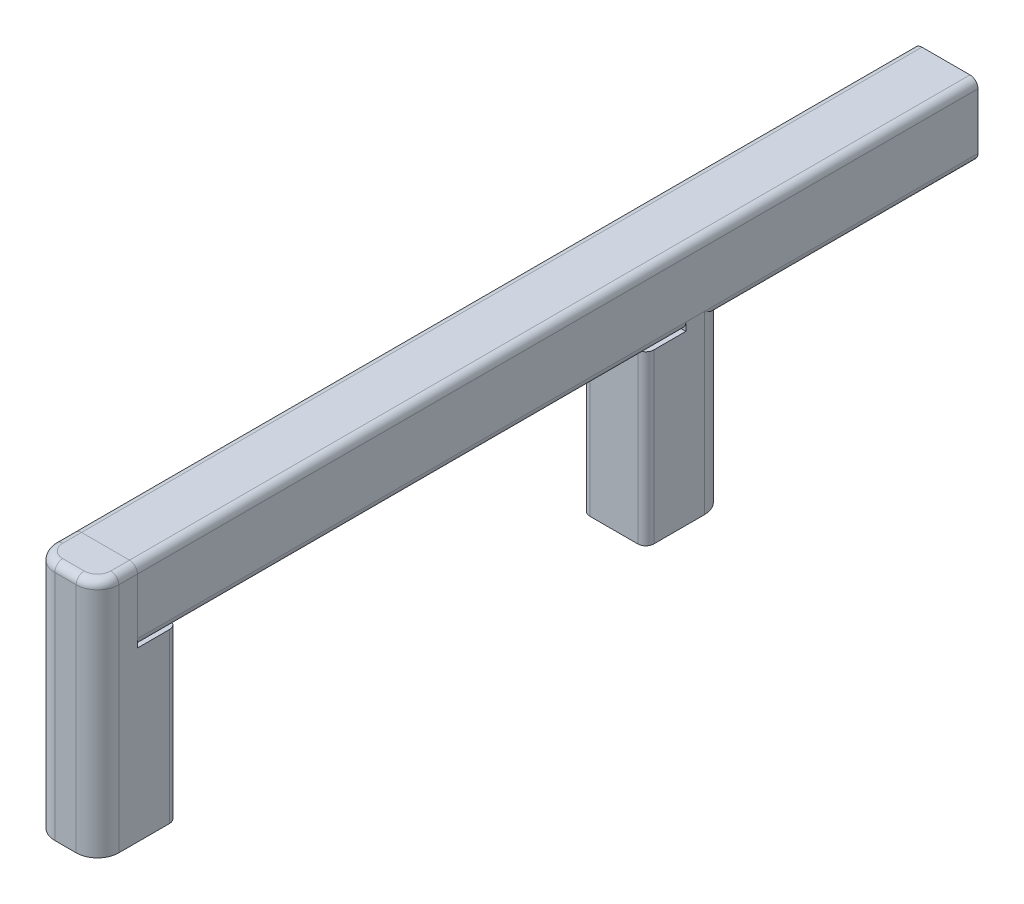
ISO-10303-21;
HEADER;
FILE_DESCRIPTION(('STEP AP214'),'2;1');
FILE_NAME('part.step','',(''),(''),'','','');
FILE_SCHEMA(('AUTOMOTIVE_DESIGN { 1 0 10303 214 1 1 1 1 }'));
ENDSEC;
DATA;
#1=APPLICATION_CONTEXT('core data for automotive mechanical design processes');
#2=APPLICATION_PROTOCOL_DEFINITION('international standard','automotive_design',2000,#1);
#3=PRODUCT_CONTEXT('',#1,'mechanical');
#4=PRODUCT('Part','Part','',(#3));
#5=PRODUCT_RELATED_PRODUCT_CATEGORY('part','',(#4));
#6=PRODUCT_DEFINITION_FORMATION('','',#4);
#7=PRODUCT_DEFINITION_CONTEXT('part definition',#1,'design');
#8=PRODUCT_DEFINITION('design','',#6,#7);
#9=PRODUCT_DEFINITION_SHAPE('','',#8);
#10=(LENGTH_UNIT() NAMED_UNIT(*) SI_UNIT(.MILLI.,.METRE.));
#11=(NAMED_UNIT(*) PLANE_ANGLE_UNIT() SI_UNIT($,.RADIAN.));
#12=(NAMED_UNIT(*) SI_UNIT($,.STERADIAN.) SOLID_ANGLE_UNIT());
#13=UNCERTAINTY_MEASURE_WITH_UNIT(LENGTH_MEASURE(1.E-05),#10,'distance_accuracy_value','');
#14=(GEOMETRIC_REPRESENTATION_CONTEXT(3) GLOBAL_UNCERTAINTY_ASSIGNED_CONTEXT((#13)) GLOBAL_UNIT_ASSIGNED_CONTEXT((#10,
#11,#12)) REPRESENTATION_CONTEXT('',''));
#15=CARTESIAN_POINT('',(0.,0.,0.));
#16=DIRECTION('',(0.,0.,1.));
#17=DIRECTION('',(1.,0.,0.));
#18=AXIS2_PLACEMENT_3D('',#15,#16,#17);
#19=CARTESIAN_POINT('',(-3.,3.50000000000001,52.5));
#20=DIRECTION('',(0.,0.,1.));
#21=DIRECTION('',(1.,0.,0.));
#22=AXIS2_PLACEMENT_3D('',#19,#20,#21);
#23=PLANE('',#22);
#24=CARTESIAN_POINT('',(-3.,3.50000000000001,52.5));
#25=DIRECTION('',(0.,0.,1.));
#26=DIRECTION('',(1.,0.,0.));
#27=AXIS2_PLACEMENT_3D('',#24,#25,#26);
#28=CIRCLE('',#27,1.);
#29=CARTESIAN_POINT('',(-3.,4.50000000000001,52.5));
#30=VERTEX_POINT('',#29);
#31=CARTESIAN_POINT('',(-4.,3.50000000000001,52.5));
#32=VERTEX_POINT('',#31);
#33=EDGE_CURVE('P0_E140',#30,#32,#28,.T.);
#34=ORIENTED_EDGE('',*,*,#33,.T.);
#35=DIRECTION('',(0.,-1.,0.));
#36=VECTOR('',#35,1.);
#37=CARTESIAN_POINT('',(-4.,3.50000000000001,52.5));
#38=LINE('',#37,#36);
#39=CARTESIAN_POINT('',(-4.,-3.49999999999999,52.5));
#40=VERTEX_POINT('',#39);
#41=EDGE_CURVE('P0_E129',#32,#40,#38,.T.);
#42=ORIENTED_EDGE('',*,*,#41,.T.);
#43=CARTESIAN_POINT('',(-3.,-3.49999999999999,52.5));
#44=DIRECTION('',(0.,0.,1.));
#45=DIRECTION('',(1.,0.,0.));
#46=AXIS2_PLACEMENT_3D('',#43,#44,#45);
#47=CIRCLE('',#46,1.);
#48=CARTESIAN_POINT('',(-3.,-4.49999999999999,52.5));
#49=VERTEX_POINT('',#48);
#50=EDGE_CURVE('P0_E139',#40,#49,#47,.T.);
#51=ORIENTED_EDGE('',*,*,#50,.T.);
#52=DIRECTION('',(1.,0.,0.));
#53=VECTOR('',#52,1.);
#54=CARTESIAN_POINT('',(-3.,-4.49999999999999,52.5));
#55=LINE('',#54,#53);
#56=CARTESIAN_POINT('',(3.,-4.49999999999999,52.5));
#57=VERTEX_POINT('',#56);
#58=EDGE_CURVE('P0_E224',#49,#57,#55,.T.);
#59=ORIENTED_EDGE('',*,*,#58,.T.);
#60=CARTESIAN_POINT('',(3.,-3.49999999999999,52.5));
#61=DIRECTION('',(0.,0.,1.));
#62=DIRECTION('',(1.,0.,0.));
#63=AXIS2_PLACEMENT_3D('',#60,#61,#62);
#64=CIRCLE('',#63,1.);
#65=CARTESIAN_POINT('',(4.,-3.49999999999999,52.5));
#66=VERTEX_POINT('',#65);
#67=EDGE_CURVE('P0_E226',#57,#66,#64,.T.);
#68=ORIENTED_EDGE('',*,*,#67,.T.);
#69=DIRECTION('',(0.,1.,0.));
#70=VECTOR('',#69,1.);
#71=CARTESIAN_POINT('',(4.,3.50000000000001,52.5));
#72=LINE('',#71,#70);
#73=CARTESIAN_POINT('',(4.,3.50000000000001,52.5));
#74=VERTEX_POINT('',#73);
#75=EDGE_CURVE('P0_E228',#66,#74,#72,.T.);
#76=ORIENTED_EDGE('',*,*,#75,.T.);
#77=CARTESIAN_POINT('',(3.,3.50000000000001,52.5));
#78=DIRECTION('',(0.,0.,1.));
#79=DIRECTION('',(-1.,0.,0.));
#80=AXIS2_PLACEMENT_3D('',#77,#78,#79);
#81=CIRCLE('',#80,1.);
#82=CARTESIAN_POINT('',(3.,4.50000000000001,52.5));
#83=VERTEX_POINT('',#82);
#84=EDGE_CURVE('P0_E230',#74,#83,#81,.T.);
#85=ORIENTED_EDGE('',*,*,#84,.T.);
#86=DIRECTION('',(-1.,0.,0.));
#87=VECTOR('',#86,1.);
#88=CARTESIAN_POINT('',(-3.,4.50000000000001,52.5));
#89=LINE('',#88,#87);
#90=EDGE_CURVE('P0_E144',#83,#30,#89,.T.);
#91=ORIENTED_EDGE('',*,*,#90,.T.);
#92=EDGE_LOOP('',(#34,#42,#51,#59,#68,#76,#85,#91));
#93=FACE_BOUND('',#92,.T.);
#94=DIRECTION('',(-1.,0.,0.));
#95=VECTOR('',#94,1.);
#96=CARTESIAN_POINT('',(-1.33333333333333,1.5,52.5));
#97=LINE('',#96,#95);
#98=CARTESIAN_POINT('',(0.833333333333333,1.5,52.5));
#99=VERTEX_POINT('',#98);
#100=CARTESIAN_POINT('',(-0.833333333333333,1.5,52.5));
#101=VERTEX_POINT('',#100);
#102=EDGE_CURVE('P0_E206',#99,#101,#97,.T.);
#103=ORIENTED_EDGE('',*,*,#102,.F.);
#104=CARTESIAN_POINT('',(0.833333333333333,1.,52.5));
#105=DIRECTION('',(0.,0.,1.));
#106=DIRECTION('',(1.,0.,0.));
#107=AXIS2_PLACEMENT_3D('',#104,#105,#106);
#108=CIRCLE('',#107,0.5);
#109=CARTESIAN_POINT('',(1.33333333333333,1.,52.5));
#110=VERTEX_POINT('',#109);
#111=EDGE_CURVE('P0_E187',#99,#110,#108,.F.);
#112=ORIENTED_EDGE('',*,*,#111,.T.);
#113=DIRECTION('',(0.,1.,0.));
#114=VECTOR('',#113,1.);
#115=CARTESIAN_POINT('',(1.33333333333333,-1.5,52.5));
#116=LINE('',#115,#114);
#117=CARTESIAN_POINT('',(1.33333333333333,-0.999999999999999,52.5));
#118=VERTEX_POINT('',#117);
#119=EDGE_CURVE('P0_E209',#118,#110,#116,.T.);
#120=ORIENTED_EDGE('',*,*,#119,.F.);
#121=CARTESIAN_POINT('',(0.833333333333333,-0.999999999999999,52.5));
#122=DIRECTION('',(0.,0.,1.));
#123=DIRECTION('',(1.,0.,0.));
#124=AXIS2_PLACEMENT_3D('',#121,#122,#123);
#125=CIRCLE('',#124,0.5);
#126=CARTESIAN_POINT('',(0.833333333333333,-1.5,52.5));
#127=VERTEX_POINT('',#126);
#128=EDGE_CURVE('P0_E183',#118,#127,#125,.F.);
#129=ORIENTED_EDGE('',*,*,#128,.T.);
#130=DIRECTION('',(1.,0.,0.));
#131=VECTOR('',#130,1.);
#132=CARTESIAN_POINT('',(-1.33333333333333,-1.5,52.5));
#133=LINE('',#132,#131);
#134=CARTESIAN_POINT('',(-0.833333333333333,-1.5,52.5));
#135=VERTEX_POINT('',#134);
#136=EDGE_CURVE('P0_E211',#135,#127,#133,.T.);
#137=ORIENTED_EDGE('',*,*,#136,.F.);
#138=CARTESIAN_POINT('',(-0.833333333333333,-0.999999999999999,52.5));
#139=DIRECTION('',(0.,0.,1.));
#140=DIRECTION('',(1.,0.,0.));
#141=AXIS2_PLACEMENT_3D('',#138,#139,#140);
#142=CIRCLE('',#141,0.5);
#143=CARTESIAN_POINT('',(-1.33333333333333,-0.999999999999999,52.5));
#144=VERTEX_POINT('',#143);
#145=EDGE_CURVE('P0_E179',#135,#144,#142,.F.);
#146=ORIENTED_EDGE('',*,*,#145,.T.);
#147=DIRECTION('',(0.,-1.,0.));
#148=VECTOR('',#147,1.);
#149=CARTESIAN_POINT('',(-1.33333333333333,-1.5,52.5));
#150=LINE('',#149,#148);
#151=CARTESIAN_POINT('',(-1.33333333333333,1.,52.5));
#152=VERTEX_POINT('',#151);
#153=EDGE_CURVE('P0_E208',#152,#144,#150,.T.);
#154=ORIENTED_EDGE('',*,*,#153,.F.);
#155=CARTESIAN_POINT('',(-0.833333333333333,0.999999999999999,52.5));
#156=DIRECTION('',(0.,0.,1.));
#157=DIRECTION('',(1.,0.,0.));
#158=AXIS2_PLACEMENT_3D('',#155,#156,#157);
#159=CIRCLE('',#158,0.5);
#160=EDGE_CURVE('P0_E11',#152,#101,#159,.F.);
#161=ORIENTED_EDGE('',*,*,#160,.T.);
#162=EDGE_LOOP('',(#103,#112,#120,#129,#137,#146,#154,#161));
#163=FACE_BOUND('',#162,.T.);
#164=ADVANCED_FACE('P0_F16',(#93,#163),#23,.T.);
#165=CARTESIAN_POINT('',(-3.,3.50000000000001,-52.5));
#166=DIRECTION('',(0.,0.,1.));
#167=DIRECTION('',(1.,0.,0.));
#168=AXIS2_PLACEMENT_3D('',#165,#166,#167);
#169=PLANE('',#168);
#170=CARTESIAN_POINT('',(-3.,3.50000000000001,-52.5));
#171=DIRECTION('',(0.,0.,1.));
#172=DIRECTION('',(1.,0.,0.));
#173=AXIS2_PLACEMENT_3D('',#170,#171,#172);
#174=CIRCLE('',#173,1.);
#175=CARTESIAN_POINT('',(-3.,4.50000000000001,-52.5));
#176=VERTEX_POINT('',#175);
#177=CARTESIAN_POINT('',(-4.,3.50000000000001,-52.5));
#178=VERTEX_POINT('',#177);
#179=EDGE_CURVE('P0_E152',#176,#178,#174,.T.);
#180=ORIENTED_EDGE('',*,*,#179,.F.);
#181=DIRECTION('',(-1.,0.,0.));
#182=VECTOR('',#181,1.);
#183=CARTESIAN_POINT('',(-3.,4.50000000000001,-52.5));
#184=LINE('',#183,#182);
#185=CARTESIAN_POINT('',(3.,4.50000000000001,-52.5));
#186=VERTEX_POINT('',#185);
#187=EDGE_CURVE('P0_E148',#186,#176,#184,.T.);
#188=ORIENTED_EDGE('',*,*,#187,.F.);
#189=CARTESIAN_POINT('',(3.,3.50000000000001,-52.5));
#190=DIRECTION('',(0.,0.,1.));
#191=DIRECTION('',(-1.,0.,0.));
#192=AXIS2_PLACEMENT_3D('',#189,#190,#191);
#193=CIRCLE('',#192,1.);
#194=CARTESIAN_POINT('',(4.,3.50000000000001,-52.5));
#195=VERTEX_POINT('',#194);
#196=EDGE_CURVE('P0_E245',#195,#186,#193,.T.);
#197=ORIENTED_EDGE('',*,*,#196,.F.);
#198=DIRECTION('',(0.,1.,0.));
#199=VECTOR('',#198,1.);
#200=CARTESIAN_POINT('',(4.,3.50000000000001,-52.5));
#201=LINE('',#200,#199);
#202=CARTESIAN_POINT('',(4.,-3.49999999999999,-52.5));
#203=VERTEX_POINT('',#202);
#204=EDGE_CURVE('P0_E243',#203,#195,#201,.T.);
#205=ORIENTED_EDGE('',*,*,#204,.F.);
#206=CARTESIAN_POINT('',(3.,-3.49999999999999,-52.5));
#207=DIRECTION('',(0.,0.,1.));
#208=DIRECTION('',(1.,0.,0.));
#209=AXIS2_PLACEMENT_3D('',#206,#207,#208);
#210=CIRCLE('',#209,1.);
#211=CARTESIAN_POINT('',(3.,-4.49999999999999,-52.5));
#212=VERTEX_POINT('',#211);
#213=EDGE_CURVE('P0_E241',#212,#203,#210,.T.);
#214=ORIENTED_EDGE('',*,*,#213,.F.);
#215=DIRECTION('',(1.,0.,0.));
#216=VECTOR('',#215,1.);
#217=CARTESIAN_POINT('',(-3.,-4.49999999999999,-52.5));
#218=LINE('',#217,#216);
#219=CARTESIAN_POINT('',(-3.,-4.49999999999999,-52.5));
#220=VERTEX_POINT('',#219);
#221=EDGE_CURVE('P0_E239',#220,#212,#218,.T.);
#222=ORIENTED_EDGE('',*,*,#221,.F.);
#223=CARTESIAN_POINT('',(-3.,-3.49999999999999,-52.5));
#224=DIRECTION('',(0.,0.,1.));
#225=DIRECTION('',(1.,0.,0.));
#226=AXIS2_PLACEMENT_3D('',#223,#224,#225);
#227=CIRCLE('',#226,1.);
#228=CARTESIAN_POINT('',(-4.,-3.49999999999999,-52.5));
#229=VERTEX_POINT('',#228);
#230=EDGE_CURVE('P0_E237',#229,#220,#227,.T.);
#231=ORIENTED_EDGE('',*,*,#230,.F.);
#232=DIRECTION('',(0.,-1.,0.));
#233=VECTOR('',#232,1.);
#234=CARTESIAN_POINT('',(-4.,3.50000000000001,-52.5));
#235=LINE('',#234,#233);
#236=EDGE_CURVE('P0_E235',#178,#229,#235,.T.);
#237=ORIENTED_EDGE('',*,*,#236,.F.);
#238=EDGE_LOOP('',(#180,#188,#197,#205,#214,#222,#231,#237));
#239=FACE_BOUND('',#238,.T.);
#240=DIRECTION('',(1.,0.,0.));
#241=VECTOR('',#240,1.);
#242=CARTESIAN_POINT('',(-1.33333333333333,-1.5,-52.5));
#243=LINE('',#242,#241);
#244=CARTESIAN_POINT('',(-0.833333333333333,-1.5,-52.5));
#245=VERTEX_POINT('',#244);
#246=CARTESIAN_POINT('',(0.833333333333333,-1.5,-52.5));
#247=VERTEX_POINT('',#246);
#248=EDGE_CURVE('P0_E203',#245,#247,#243,.T.);
#249=ORIENTED_EDGE('',*,*,#248,.T.);
#250=CARTESIAN_POINT('',(0.833333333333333,-0.999999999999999,-52.5));
#251=DIRECTION('',(0.,0.,1.));
#252=DIRECTION('',(1.,0.,0.));
#253=AXIS2_PLACEMENT_3D('',#250,#251,#252);
#254=CIRCLE('',#253,0.5);
#255=CARTESIAN_POINT('',(1.33333333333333,-0.999999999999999,-52.5));
#256=VERTEX_POINT('',#255);
#257=EDGE_CURVE('P0_E181',#247,#256,#254,.T.);
#258=ORIENTED_EDGE('',*,*,#257,.T.);
#259=DIRECTION('',(0.,1.,0.));
#260=VECTOR('',#259,1.);
#261=CARTESIAN_POINT('',(1.33333333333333,-1.5,-52.5));
#262=LINE('',#261,#260);
#263=CARTESIAN_POINT('',(1.33333333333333,1.,-52.5));
#264=VERTEX_POINT('',#263);
#265=EDGE_CURVE('P0_E218',#256,#264,#262,.T.);
#266=ORIENTED_EDGE('',*,*,#265,.T.);
#267=CARTESIAN_POINT('',(0.833333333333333,1.,-52.5));
#268=DIRECTION('',(0.,0.,1.));
#269=DIRECTION('',(1.,0.,0.));
#270=AXIS2_PLACEMENT_3D('',#267,#268,#269);
#271=CIRCLE('',#270,0.5);
#272=CARTESIAN_POINT('',(0.833333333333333,1.5,-52.5));
#273=VERTEX_POINT('',#272);
#274=EDGE_CURVE('P0_E185',#264,#273,#271,.T.);
#275=ORIENTED_EDGE('',*,*,#274,.T.);
#276=DIRECTION('',(-1.,0.,0.));
#277=VECTOR('',#276,1.);
#278=CARTESIAN_POINT('',(-1.33333333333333,1.5,-52.5));
#279=LINE('',#278,#277);
#280=CARTESIAN_POINT('',(-0.833333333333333,1.5,-52.5));
#281=VERTEX_POINT('',#280);
#282=EDGE_CURVE('P0_E195',#273,#281,#279,.T.);
#283=ORIENTED_EDGE('',*,*,#282,.T.);
#284=CARTESIAN_POINT('',(-0.833333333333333,0.999999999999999,-52.5));
#285=DIRECTION('',(0.,0.,1.));
#286=DIRECTION('',(1.,0.,0.));
#287=AXIS2_PLACEMENT_3D('',#284,#285,#286);
#288=CIRCLE('',#287,0.5);
#289=CARTESIAN_POINT('',(-1.33333333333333,1.,-52.5));
#290=VERTEX_POINT('',#289);
#291=EDGE_CURVE('P0_E24',#281,#290,#288,.T.);
#292=ORIENTED_EDGE('',*,*,#291,.T.);
#293=DIRECTION('',(0.,-1.,0.));
#294=VECTOR('',#293,1.);
#295=CARTESIAN_POINT('',(-1.33333333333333,-1.5,-52.5));
#296=LINE('',#295,#294);
#297=CARTESIAN_POINT('',(-1.33333333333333,-0.999999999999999,-52.5));
#298=VERTEX_POINT('',#297);
#299=EDGE_CURVE('P0_E194',#290,#298,#296,.T.);
#300=ORIENTED_EDGE('',*,*,#299,.T.);
#301=CARTESIAN_POINT('',(-0.833333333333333,-0.999999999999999,-52.5));
#302=DIRECTION('',(0.,0.,1.));
#303=DIRECTION('',(1.,0.,0.));
#304=AXIS2_PLACEMENT_3D('',#301,#302,#303);
#305=CIRCLE('',#304,0.5);
#306=EDGE_CURVE('P0_E177',#298,#245,#305,.T.);
#307=ORIENTED_EDGE('',*,*,#306,.T.);
#308=EDGE_LOOP('',(#249,#258,#266,#275,#283,#292,#300,#307));
#309=FACE_BOUND('',#308,.T.);
#310=ADVANCED_FACE('P0_F193',(#239,#309),#169,.F.);
#311=CARTESIAN_POINT('',(-3.,3.50000000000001,52.5));
#312=DIRECTION('',(0.,0.,-1.));
#313=DIRECTION('',(-1.,0.,0.));
#314=AXIS2_PLACEMENT_3D('',#311,#312,#313);
#315=CYLINDRICAL_SURFACE('',#314,1.);
#316=ORIENTED_EDGE('',*,*,#179,.T.);
#317=DIRECTION('',(0.,0.,-1.));
#318=VECTOR('',#317,1.);
#319=CARTESIAN_POINT('',(-4.,3.50000000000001,52.5));
#320=LINE('',#319,#318);
#321=EDGE_CURVE('P0_E133',#32,#178,#320,.T.);
#322=ORIENTED_EDGE('',*,*,#321,.F.);
#323=ORIENTED_EDGE('',*,*,#33,.F.);
#324=DIRECTION('',(0.,0.,-1.));
#325=VECTOR('',#324,1.);
#326=CARTESIAN_POINT('',(-3.,4.50000000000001,52.5));
#327=LINE('',#326,#325);
#328=EDGE_CURVE('P0_E233',#30,#176,#327,.T.);
#329=ORIENTED_EDGE('',*,*,#328,.T.);
#330=EDGE_LOOP('',(#316,#322,#323,#329));
#331=FACE_BOUND('',#330,.T.);
#332=ADVANCED_FACE('P0_F150',(#331),#315,.T.);
#333=CARTESIAN_POINT('',(-4.,3.50000000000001,52.5));
#334=DIRECTION('',(1.,0.,0.));
#335=DIRECTION('',(0.,0.,-1.));
#336=AXIS2_PLACEMENT_3D('',#333,#334,#335);
#337=PLANE('',#336);
#338=ORIENTED_EDGE('',*,*,#236,.T.);
#339=DIRECTION('',(0.,0.,-1.));
#340=VECTOR('',#339,1.);
#341=CARTESIAN_POINT('',(-4.,-3.49999999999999,52.5));
#342=LINE('',#341,#340);
#343=EDGE_CURVE('P0_E136',#40,#229,#342,.T.);
#344=ORIENTED_EDGE('',*,*,#343,.F.);
#345=ORIENTED_EDGE('',*,*,#41,.F.);
#346=ORIENTED_EDGE('',*,*,#321,.T.);
#347=EDGE_LOOP('',(#338,#344,#345,#346));
#348=FACE_BOUND('',#347,.T.);
#349=ADVANCED_FACE('P0_F131',(#348),#337,.F.);
#350=CARTESIAN_POINT('',(-3.,-3.49999999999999,52.5));
#351=DIRECTION('',(0.,0.,-1.));
#352=DIRECTION('',(-1.,0.,0.));
#353=AXIS2_PLACEMENT_3D('',#350,#351,#352);
#354=CYLINDRICAL_SURFACE('',#353,1.);
#355=ORIENTED_EDGE('',*,*,#230,.T.);
#356=DIRECTION('',(0.,0.,-1.));
#357=VECTOR('',#356,1.);
#358=CARTESIAN_POINT('',(-3.,-4.49999999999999,52.5));
#359=LINE('',#358,#357);
#360=EDGE_CURVE('P0_E157',#49,#220,#359,.T.);
#361=ORIENTED_EDGE('',*,*,#360,.F.);
#362=ORIENTED_EDGE('',*,*,#50,.F.);
#363=ORIENTED_EDGE('',*,*,#343,.T.);
#364=EDGE_LOOP('',(#355,#361,#362,#363));
#365=FACE_BOUND('',#364,.T.);
#366=ADVANCED_FACE('P0_F283',(#365),#354,.T.);
#367=CARTESIAN_POINT('',(-3.,-4.49999999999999,52.5));
#368=DIRECTION('',(0.,1.,0.));
#369=DIRECTION('',(0.,0.,1.));
#370=AXIS2_PLACEMENT_3D('',#367,#368,#369);
#371=PLANE('',#370);
#372=ORIENTED_EDGE('',*,*,#221,.T.);
#373=DIRECTION('',(0.,0.,-1.));
#374=VECTOR('',#373,1.);
#375=CARTESIAN_POINT('',(3.,-4.49999999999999,52.5));
#376=LINE('',#375,#374);
#377=EDGE_CURVE('P0_E258',#57,#212,#376,.T.);
#378=ORIENTED_EDGE('',*,*,#377,.F.);
#379=ORIENTED_EDGE('',*,*,#58,.F.);
#380=ORIENTED_EDGE('',*,*,#360,.T.);
#381=EDGE_LOOP('',(#372,#378,#379,#380));
#382=FACE_BOUND('',#381,.T.);
#383=ADVANCED_FACE('P0_F265',(#382),#371,.F.);
#384=CARTESIAN_POINT('',(3.,-3.49999999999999,52.5));
#385=DIRECTION('',(0.,0.,-1.));
#386=DIRECTION('',(-1.,0.,0.));
#387=AXIS2_PLACEMENT_3D('',#384,#385,#386);
#388=CYLINDRICAL_SURFACE('',#387,1.);
#389=ORIENTED_EDGE('',*,*,#213,.T.);
#390=DIRECTION('',(0.,0.,-1.));
#391=VECTOR('',#390,1.);
#392=CARTESIAN_POINT('',(4.,-3.49999999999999,52.5));
#393=LINE('',#392,#391);
#394=EDGE_CURVE('P0_E255',#66,#203,#393,.T.);
#395=ORIENTED_EDGE('',*,*,#394,.F.);
#396=ORIENTED_EDGE('',*,*,#67,.F.);
#397=ORIENTED_EDGE('',*,*,#377,.T.);
#398=EDGE_LOOP('',(#389,#395,#396,#397));
#399=FACE_BOUND('',#398,.T.);
#400=ADVANCED_FACE('P0_F275',(#399),#388,.T.);
#401=CARTESIAN_POINT('',(4.,3.50000000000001,52.5));
#402=DIRECTION('',(-1.,0.,0.));
#403=DIRECTION('',(0.,0.,1.));
#404=AXIS2_PLACEMENT_3D('',#401,#402,#403);
#405=PLANE('',#404);
#406=ORIENTED_EDGE('',*,*,#204,.T.);
#407=DIRECTION('',(0.,0.,-1.));
#408=VECTOR('',#407,1.);
#409=CARTESIAN_POINT('',(4.,3.50000000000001,52.5));
#410=LINE('',#409,#408);
#411=EDGE_CURVE('P0_E252',#74,#195,#410,.T.);
#412=ORIENTED_EDGE('',*,*,#411,.F.);
#413=ORIENTED_EDGE('',*,*,#75,.F.);
#414=ORIENTED_EDGE('',*,*,#394,.T.);
#415=EDGE_LOOP('',(#406,#412,#413,#414));
#416=FACE_BOUND('',#415,.T.);
#417=ADVANCED_FACE('P0_F279',(#416),#405,.F.);
#418=CARTESIAN_POINT('',(3.,3.50000000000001,52.5));
#419=DIRECTION('',(0.,0.,-1.));
#420=DIRECTION('',(-1.,0.,0.));
#421=AXIS2_PLACEMENT_3D('',#418,#419,#420);
#422=CYLINDRICAL_SURFACE('',#421,1.);
#423=ORIENTED_EDGE('',*,*,#196,.T.);
#424=DIRECTION('',(0.,0.,-1.));
#425=VECTOR('',#424,1.);
#426=CARTESIAN_POINT('',(3.,4.50000000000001,52.5));
#427=LINE('',#426,#425);
#428=EDGE_CURVE('P0_E249',#83,#186,#427,.T.);
#429=ORIENTED_EDGE('',*,*,#428,.F.);
#430=ORIENTED_EDGE('',*,*,#84,.F.);
#431=ORIENTED_EDGE('',*,*,#411,.T.);
#432=EDGE_LOOP('',(#423,#429,#430,#431));
#433=FACE_BOUND('',#432,.T.);
#434=ADVANCED_FACE('P0_F306',(#433),#422,.T.);
#435=CARTESIAN_POINT('',(-3.,4.50000000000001,52.5));
#436=DIRECTION('',(0.,-1.,0.));
#437=DIRECTION('',(0.,0.,-1.));
#438=AXIS2_PLACEMENT_3D('',#435,#436,#437);
#439=PLANE('',#438);
#440=ORIENTED_EDGE('',*,*,#187,.T.);
#441=ORIENTED_EDGE('',*,*,#328,.F.);
#442=ORIENTED_EDGE('',*,*,#90,.F.);
#443=ORIENTED_EDGE('',*,*,#428,.T.);
#444=EDGE_LOOP('',(#440,#441,#442,#443));
#445=FACE_BOUND('',#444,.T.);
#446=ADVANCED_FACE('P0_F303',(#445),#439,.F.);
#447=CARTESIAN_POINT('',(1.33333333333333,-1.5,52.5));
#448=DIRECTION('',(-1.,0.,0.));
#449=DIRECTION('',(0.,0.,1.));
#450=AXIS2_PLACEMENT_3D('',#447,#448,#449);
#451=PLANE('',#450);
#452=ORIENTED_EDGE('',*,*,#265,.F.);
#453=DIRECTION('',(0.,0.,-1.));
#454=VECTOR('',#453,1.);
#455=CARTESIAN_POINT('',(1.33333333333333,-0.999999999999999,52.5));
#456=LINE('',#455,#454);
#457=EDGE_CURVE('P0_E171',#256,#118,#456,.F.);
#458=ORIENTED_EDGE('',*,*,#457,.T.);
#459=ORIENTED_EDGE('',*,*,#119,.T.);
#460=DIRECTION('',(0.,0.,-1.));
#461=VECTOR('',#460,1.);
#462=CARTESIAN_POINT('',(1.33333333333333,1.,-52.5));
#463=LINE('',#462,#461);
#464=EDGE_CURVE('P0_E168',#110,#264,#463,.T.);
#465=ORIENTED_EDGE('',*,*,#464,.T.);
#466=EDGE_LOOP('',(#452,#458,#459,#465));
#467=FACE_BOUND('',#466,.T.);
#468=ADVANCED_FACE('P0_F300',(#467),#451,.T.);
#469=CARTESIAN_POINT('',(-1.33333333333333,1.5,52.5));
#470=DIRECTION('',(0.,-1.,0.));
#471=DIRECTION('',(1.,0.,0.));
#472=AXIS2_PLACEMENT_3D('',#469,#470,#471);
#473=PLANE('',#472);
#474=ORIENTED_EDGE('',*,*,#282,.F.);
#475=DIRECTION('',(0.,0.,-1.));
#476=VECTOR('',#475,1.);
#477=CARTESIAN_POINT('',(0.833333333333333,1.5,52.5));
#478=LINE('',#477,#476);
#479=EDGE_CURVE('P0_E36',#273,#99,#478,.F.);
#480=ORIENTED_EDGE('',*,*,#479,.T.);
#481=ORIENTED_EDGE('',*,*,#102,.T.);
#482=DIRECTION('',(0.,0.,-1.));
#483=VECTOR('',#482,1.);
#484=CARTESIAN_POINT('',(-0.833333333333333,1.5,-52.5));
#485=LINE('',#484,#483);
#486=EDGE_CURVE('P0_E173',#101,#281,#485,.T.);
#487=ORIENTED_EDGE('',*,*,#486,.T.);
#488=EDGE_LOOP('',(#474,#480,#481,#487));
#489=FACE_BOUND('',#488,.T.);
#490=ADVANCED_FACE('P0_F205',(#489),#473,.T.);
#491=CARTESIAN_POINT('',(-1.33333333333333,-1.5,52.5));
#492=DIRECTION('',(1.,0.,0.));
#493=DIRECTION('',(0.,0.,-1.));
#494=AXIS2_PLACEMENT_3D('',#491,#492,#493);
#495=PLANE('',#494);
#496=ORIENTED_EDGE('',*,*,#153,.T.);
#497=DIRECTION('',(0.,0.,-1.));
#498=VECTOR('',#497,1.);
#499=CARTESIAN_POINT('',(-1.33333333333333,-0.999999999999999,-52.5));
#500=LINE('',#499,#498);
#501=EDGE_CURVE('P0_E155',#144,#298,#500,.T.);
#502=ORIENTED_EDGE('',*,*,#501,.T.);
#503=ORIENTED_EDGE('',*,*,#299,.F.);
#504=DIRECTION('',(0.,0.,-1.));
#505=VECTOR('',#504,1.);
#506=CARTESIAN_POINT('',(-1.33333333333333,0.999999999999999,52.5));
#507=LINE('',#506,#505);
#508=EDGE_CURVE('P0_E153',#290,#152,#507,.F.);
#509=ORIENTED_EDGE('',*,*,#508,.T.);
#510=EDGE_LOOP('',(#496,#502,#503,#509));
#511=FACE_BOUND('',#510,.T.);
#512=ADVANCED_FACE('P0_F201',(#511),#495,.T.);
#513=CARTESIAN_POINT('',(-1.33333333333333,-1.5,52.5));
#514=DIRECTION('',(0.,1.,0.));
#515=DIRECTION('',(0.,0.,1.));
#516=AXIS2_PLACEMENT_3D('',#513,#514,#515);
#517=PLANE('',#516);
#518=ORIENTED_EDGE('',*,*,#248,.F.);
#519=DIRECTION('',(0.,0.,-1.));
#520=VECTOR('',#519,1.);
#521=CARTESIAN_POINT('',(-0.833333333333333,-1.5,52.5));
#522=LINE('',#521,#520);
#523=EDGE_CURVE('P0_E166',#245,#135,#522,.F.);
#524=ORIENTED_EDGE('',*,*,#523,.T.);
#525=ORIENTED_EDGE('',*,*,#136,.T.);
#526=DIRECTION('',(0.,0.,-1.));
#527=VECTOR('',#526,1.);
#528=CARTESIAN_POINT('',(0.833333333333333,-1.5,-52.5));
#529=LINE('',#528,#527);
#530=EDGE_CURVE('P0_E163',#127,#247,#529,.T.);
#531=ORIENTED_EDGE('',*,*,#530,.T.);
#532=EDGE_LOOP('',(#518,#524,#525,#531));
#533=FACE_BOUND('',#532,.T.);
#534=ADVANCED_FACE('P0_F355',(#533),#517,.T.);
#535=CARTESIAN_POINT('',(-0.833333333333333,-0.999999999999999,52.5));
#536=DIRECTION('',(0.,0.,1.));
#537=DIRECTION('',(1.,0.,0.));
#538=AXIS2_PLACEMENT_3D('',#535,#536,#537);
#539=CYLINDRICAL_SURFACE('',#538,0.5);
#540=ORIENTED_EDGE('',*,*,#145,.F.);
#541=ORIENTED_EDGE('',*,*,#523,.F.);
#542=ORIENTED_EDGE('',*,*,#306,.F.);
#543=ORIENTED_EDGE('',*,*,#501,.F.);
#544=EDGE_LOOP('',(#540,#541,#542,#543));
#545=FACE_BOUND('',#544,.T.);
#546=ADVANCED_FACE('P0_F363',(#545),#539,.F.);
#547=CARTESIAN_POINT('',(0.833333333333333,-0.999999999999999,52.5));
#548=DIRECTION('',(0.,0.,1.));
#549=DIRECTION('',(1.,0.,0.));
#550=AXIS2_PLACEMENT_3D('',#547,#548,#549);
#551=CYLINDRICAL_SURFACE('',#550,0.5);
#552=ORIENTED_EDGE('',*,*,#128,.F.);
#553=ORIENTED_EDGE('',*,*,#457,.F.);
#554=ORIENTED_EDGE('',*,*,#257,.F.);
#555=ORIENTED_EDGE('',*,*,#530,.F.);
#556=EDGE_LOOP('',(#552,#553,#554,#555));
#557=FACE_BOUND('',#556,.T.);
#558=ADVANCED_FACE('P0_F372',(#557),#551,.F.);
#559=CARTESIAN_POINT('',(0.833333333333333,1.,52.5));
#560=DIRECTION('',(0.,0.,1.));
#561=DIRECTION('',(1.,0.,0.));
#562=AXIS2_PLACEMENT_3D('',#559,#560,#561);
#563=CYLINDRICAL_SURFACE('',#562,0.5);
#564=ORIENTED_EDGE('',*,*,#111,.F.);
#565=ORIENTED_EDGE('',*,*,#479,.F.);
#566=ORIENTED_EDGE('',*,*,#274,.F.);
#567=ORIENTED_EDGE('',*,*,#464,.F.);
#568=EDGE_LOOP('',(#564,#565,#566,#567));
#569=FACE_BOUND('',#568,.T.);
#570=ADVANCED_FACE('P0_F381',(#569),#563,.F.);
#571=CARTESIAN_POINT('',(-0.833333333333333,0.999999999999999,52.5));
#572=DIRECTION('',(0.,0.,1.));
#573=DIRECTION('',(1.,0.,0.));
#574=AXIS2_PLACEMENT_3D('',#571,#572,#573);
#575=CYLINDRICAL_SURFACE('',#574,0.5);
#576=ORIENTED_EDGE('',*,*,#160,.F.);
#577=ORIENTED_EDGE('',*,*,#508,.F.);
#578=ORIENTED_EDGE('',*,*,#291,.F.);
#579=ORIENTED_EDGE('',*,*,#486,.F.);
#580=EDGE_LOOP('',(#576,#577,#578,#579));
#581=FACE_BOUND('',#580,.T.);
#582=ADVANCED_FACE('P0_F18',(#581),#575,.F.);
#583=CLOSED_SHELL('',(#164,#310,#332,#349,#366,#383,#400,#417,#434,#446,#468,#490,#512,#534,
#546,#558,#570,#582));
#584=MANIFOLD_SOLID_BREP('P0_B1',#583);
#585=CARTESIAN_POINT('',(0.,-25.5,-16.));
#586=DIRECTION('',(0.,1.,0.));
#587=DIRECTION('',(-1.,0.,0.));
#588=AXIS2_PLACEMENT_3D('',#585,#586,#587);
#589=CYLINDRICAL_SURFACE('',#588,3.24999999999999);
#590=CARTESIAN_POINT('',(0.,-11.2769088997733,-16.));
#591=DIRECTION('',(0.,1.,0.));
#592=DIRECTION('',(-1.,0.,0.));
#593=AXIS2_PLACEMENT_3D('',#590,#591,#592);
#594=CIRCLE('',#593,3.24999999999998);
#595=CARTESIAN_POINT('',(-3.24999999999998,-11.2769088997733,-16.));
#596=VERTEX_POINT('',#595);
#597=EDGE_CURVE('P1_E11',#596,#596,#594,.T.);
#598=ORIENTED_EDGE('',*,*,#597,.F.);
#599=EDGE_LOOP('',(#598));
#600=FACE_BOUND('',#599,.T.);
#601=CARTESIAN_POINT('',(0.,-25.5,-16.));
#602=DIRECTION('',(0.,1.,0.));
#603=DIRECTION('',(-1.,0.,0.));
#604=AXIS2_PLACEMENT_3D('',#601,#602,#603);
#605=CIRCLE('',#604,3.25);
#606=CARTESIAN_POINT('',(-3.25,-25.5,-16.));
#607=VERTEX_POINT('',#606);
#608=EDGE_CURVE('P1_E51',#607,#607,#605,.T.);
#609=ORIENTED_EDGE('',*,*,#608,.T.);
#610=EDGE_LOOP('',(#609));
#611=FACE_BOUND('',#610,.T.);
#612=ADVANCED_FACE('P1_F16',(#600,#611),#589,.T.);
#613=CARTESIAN_POINT('',(0.,-11.2769088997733,-16.));
#614=DIRECTION('',(0.,1.,0.));
#615=DIRECTION('',(-1.,0.,0.));
#616=AXIS2_PLACEMENT_3D('',#613,#614,#615);
#617=TOROIDAL_SURFACE('',#616,2.25,0.999999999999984);
#618=CARTESIAN_POINT('',(0.,-10.2807142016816,-16.));
#619=DIRECTION('',(0.,1.,0.));
#620=DIRECTION('',(-1.,0.,0.));
#621=AXIS2_PLACEMENT_3D('',#618,#619,#620);
#622=CIRCLE('',#621,2.33715574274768);
#623=CARTESIAN_POINT('',(-2.33715574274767,-10.2807142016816,-16.));
#624=VERTEX_POINT('',#623);
#625=EDGE_CURVE('P1_E23',#624,#624,#622,.T.);
#626=ORIENTED_EDGE('',*,*,#625,.F.);
#627=EDGE_LOOP('',(#626));
#628=FACE_BOUND('',#627,.T.);
#629=ORIENTED_EDGE('',*,*,#597,.T.);
#630=EDGE_LOOP('',(#629));
#631=FACE_BOUND('',#630,.T.);
#632=ADVANCED_FACE('P1_F33',(#628,#631),#617,.T.);
#633=CARTESIAN_POINT('',(0.,-10.2807142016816,-16.));
#634=DIRECTION('',(0.,-1.,0.));
#635=DIRECTION('',(1.,0.,0.));
#636=AXIS2_PLACEMENT_3D('',#633,#634,#635);
#637=CONICAL_SURFACE('',#636,2.33715574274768,1.48352986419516);
#638=CARTESIAN_POINT('',(0.,-10.0762395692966,-16.));
#639=VERTEX_POINT('',#638);
#640=VERTEX_LOOP('',#639);
#641=FACE_BOUND('',#640,.T.);
#642=ORIENTED_EDGE('',*,*,#625,.T.);
#643=EDGE_LOOP('',(#642));
#644=FACE_BOUND('',#643,.T.);
#645=ADVANCED_FACE('P1_F29',(#641,#644),#637,.T.);
#646=CARTESIAN_POINT('',(0.,-13.5762395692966,-16.));
#647=DIRECTION('',(0.,-1.,0.));
#648=DIRECTION('',(1.,0.,0.));
#649=AXIS2_PLACEMENT_3D('',#646,#647,#648);
#650=CONICAL_SURFACE('',#649,0.,1.04719755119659);
#651=CARTESIAN_POINT('',(0.,-14.5,-16.));
#652=DIRECTION('',(0.,1.,0.));
#653=DIRECTION('',(-1.,0.,0.));
#654=AXIS2_PLACEMENT_3D('',#651,#652,#653);
#655=CIRCLE('',#654,1.6);
#656=CARTESIAN_POINT('',(-1.6,-14.5,-16.));
#657=VERTEX_POINT('',#656);
#658=EDGE_CURVE('P1_E38',#657,#657,#655,.T.);
#659=ORIENTED_EDGE('',*,*,#658,.F.);
#660=EDGE_LOOP('',(#659));
#661=FACE_BOUND('',#660,.T.);
#662=CARTESIAN_POINT('',(0.,-13.5762395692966,-16.));
#663=VERTEX_POINT('',#662);
#664=VERTEX_LOOP('',#663);
#665=FACE_BOUND('',#664,.T.);
#666=ADVANCED_FACE('P1_F32',(#661,#665),#650,.F.);
#667=CARTESIAN_POINT('',(0.,-25.5,-16.));
#668=DIRECTION('',(0.,1.,0.));
#669=DIRECTION('',(-1.,0.,0.));
#670=AXIS2_PLACEMENT_3D('',#667,#668,#669);
#671=CYLINDRICAL_SURFACE('',#670,1.6);
#672=CARTESIAN_POINT('',(0.,-17.5,-16.));
#673=DIRECTION('',(0.,1.,0.));
#674=DIRECTION('',(-1.,0.,0.));
#675=AXIS2_PLACEMENT_3D('',#672,#673,#674);
#676=CIRCLE('',#675,1.6);
#677=CARTESIAN_POINT('',(-1.6,-17.5,-16.));
#678=VERTEX_POINT('',#677);
#679=EDGE_CURVE('P1_E40',#678,#678,#676,.T.);
#680=ORIENTED_EDGE('',*,*,#679,.F.);
#681=EDGE_LOOP('',(#680));
#682=FACE_BOUND('',#681,.T.);
#683=ORIENTED_EDGE('',*,*,#658,.T.);
#684=EDGE_LOOP('',(#683));
#685=FACE_BOUND('',#684,.T.);
#686=ADVANCED_FACE('P1_F71',(#682,#685),#671,.F.);
#687=CARTESIAN_POINT('',(0.,-17.5,-14.));
#688=DIRECTION('',(0.,1.,0.));
#689=DIRECTION('',(-1.,0.,0.));
#690=AXIS2_PLACEMENT_3D('',#687,#688,#689);
#691=PLANE('',#690);
#692=CARTESIAN_POINT('',(0.,-17.5,-16.));
#693=DIRECTION('',(0.,1.,0.));
#694=DIRECTION('',(-1.,0.,0.));
#695=AXIS2_PLACEMENT_3D('',#692,#693,#694);
#696=CIRCLE('',#695,2.);
#697=CARTESIAN_POINT('',(-2.,-17.5,-16.));
#698=VERTEX_POINT('',#697);
#699=EDGE_CURVE('P1_E45',#698,#698,#696,.T.);
#700=ORIENTED_EDGE('',*,*,#699,.F.);
#701=EDGE_LOOP('',(#700));
#702=FACE_BOUND('',#701,.T.);
#703=ORIENTED_EDGE('',*,*,#679,.T.);
#704=EDGE_LOOP('',(#703));
#705=FACE_BOUND('',#704,.T.);
#706=ADVANCED_FACE('P1_F65',(#702,#705),#691,.F.);
#707=CARTESIAN_POINT('',(0.,-25.5,-16.));
#708=DIRECTION('',(0.,1.,0.));
#709=DIRECTION('',(-1.,0.,0.));
#710=AXIS2_PLACEMENT_3D('',#707,#708,#709);
#711=CYLINDRICAL_SURFACE('',#710,2.);
#712=CARTESIAN_POINT('',(0.,-25.5,-16.));
#713=DIRECTION('',(0.,1.,0.));
#714=DIRECTION('',(-1.,0.,0.));
#715=AXIS2_PLACEMENT_3D('',#712,#713,#714);
#716=CIRCLE('',#715,2.);
#717=CARTESIAN_POINT('',(-2.,-25.5,-16.));
#718=VERTEX_POINT('',#717);
#719=EDGE_CURVE('P1_E48',#718,#718,#716,.T.);
#720=ORIENTED_EDGE('',*,*,#719,.F.);
#721=EDGE_LOOP('',(#720));
#722=FACE_BOUND('',#721,.T.);
#723=ORIENTED_EDGE('',*,*,#699,.T.);
#724=EDGE_LOOP('',(#723));
#725=FACE_BOUND('',#724,.T.);
#726=ADVANCED_FACE('P1_F59',(#722,#725),#711,.F.);
#727=CARTESIAN_POINT('',(0.,-25.5,-14.));
#728=DIRECTION('',(0.,1.,0.));
#729=DIRECTION('',(-1.,0.,0.));
#730=AXIS2_PLACEMENT_3D('',#727,#728,#729);
#731=PLANE('',#730);
#732=ORIENTED_EDGE('',*,*,#608,.F.);
#733=EDGE_LOOP('',(#732));
#734=FACE_BOUND('',#733,.T.);
#735=ORIENTED_EDGE('',*,*,#719,.T.);
#736=EDGE_LOOP('',(#735));
#737=FACE_BOUND('',#736,.T.);
#738=ADVANCED_FACE('P1_F56',(#734,#737),#731,.F.);
#739=CLOSED_SHELL('',(#612,#632,#645,#666,#686,#706,#726,#738));
#740=MANIFOLD_SOLID_BREP('P1_B1',#739);
#741=CARTESIAN_POINT('',(-1.33333333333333,-25.5,-18.3333333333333));
#742=DIRECTION('',(0.,1.,0.));
#743=DIRECTION('',(-1.,0.,0.));
#744=AXIS2_PLACEMENT_3D('',#741,#742,#743);
#745=PLANE('',#744);
#746=DIRECTION('',(0.,0.,-1.));
#747=VECTOR('',#746,1.);
#748=CARTESIAN_POINT('',(4.,-25.5,-18.3333333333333));
#749=LINE('',#748,#747);
#750=CARTESIAN_POINT('',(4.,-25.5,-12.));
#751=VERTEX_POINT('',#750);
#752=CARTESIAN_POINT('',(4.,-25.5,-18.3333333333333));
#753=VERTEX_POINT('',#752);
#754=EDGE_CURVE('P2_E225',#751,#753,#749,.T.);
#755=ORIENTED_EDGE('',*,*,#754,.F.);
#756=CARTESIAN_POINT('',(3.,-25.5,-12.));
#757=DIRECTION('',(0.,1.,0.));
#758=DIRECTION('',(-1.,0.,0.));
#759=AXIS2_PLACEMENT_3D('',#756,#757,#758);
#760=CIRCLE('',#759,1.);
#761=CARTESIAN_POINT('',(3.,-25.5,-11.));
#762=VERTEX_POINT('',#761);
#763=EDGE_CURVE('P2_E276',#751,#762,#760,.F.);
#764=ORIENTED_EDGE('',*,*,#763,.T.);
#765=DIRECTION('',(1.,0.,0.));
#766=VECTOR('',#765,1.);
#767=CARTESIAN_POINT('',(4.,-25.5,-11.));
#768=LINE('',#767,#766);
#769=CARTESIAN_POINT('',(-3.,-25.5,-11.));
#770=VERTEX_POINT('',#769);
#771=EDGE_CURVE('P2_E220',#770,#762,#768,.T.);
#772=ORIENTED_EDGE('',*,*,#771,.F.);
#773=CARTESIAN_POINT('',(-3.,-25.5,-12.));
#774=DIRECTION('',(0.,1.,0.));
#775=DIRECTION('',(-1.,0.,0.));
#776=AXIS2_PLACEMENT_3D('',#773,#774,#775);
#777=CIRCLE('',#776,1.);
#778=CARTESIAN_POINT('',(-4.,-25.5,-12.));
#779=VERTEX_POINT('',#778);
#780=EDGE_CURVE('P2_E274',#770,#779,#777,.F.);
#781=ORIENTED_EDGE('',*,*,#780,.T.);
#782=DIRECTION('',(0.,0.,1.));
#783=VECTOR('',#782,1.);
#784=CARTESIAN_POINT('',(-4.,-25.5,-18.3333333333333));
#785=LINE('',#784,#783);
#786=CARTESIAN_POINT('',(-4.,-25.5,-18.3333333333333));
#787=VERTEX_POINT('',#786);
#788=EDGE_CURVE('P2_E237',#787,#779,#785,.T.);
#789=ORIENTED_EDGE('',*,*,#788,.F.);
#790=CARTESIAN_POINT('',(-1.33333333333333,-25.5,-18.3333333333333));
#791=DIRECTION('',(0.,1.,0.));
#792=DIRECTION('',(-1.,0.,0.));
#793=AXIS2_PLACEMENT_3D('',#790,#791,#792);
#794=CIRCLE('',#793,2.66666666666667);
#795=CARTESIAN_POINT('',(-1.33333333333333,-25.5,-21.));
#796=VERTEX_POINT('',#795);
#797=EDGE_CURVE('P2_E234',#796,#787,#794,.T.);
#798=ORIENTED_EDGE('',*,*,#797,.F.);
#799=DIRECTION('',(-1.,0.,0.));
#800=VECTOR('',#799,1.);
#801=CARTESIAN_POINT('',(1.33333333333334,-25.5,-21.));
#802=LINE('',#801,#800);
#803=CARTESIAN_POINT('',(1.33333333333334,-25.5,-21.));
#804=VERTEX_POINT('',#803);
#805=EDGE_CURVE('P2_E231',#804,#796,#802,.T.);
#806=ORIENTED_EDGE('',*,*,#805,.F.);
#807=CARTESIAN_POINT('',(1.33333333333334,-25.5,-18.3333333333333));
#808=DIRECTION('',(0.,1.,0.));
#809=DIRECTION('',(-1.,0.,0.));
#810=AXIS2_PLACEMENT_3D('',#807,#808,#809);
#811=CIRCLE('',#810,2.66666666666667);
#812=EDGE_CURVE('P2_E228',#753,#804,#811,.T.);
#813=ORIENTED_EDGE('',*,*,#812,.F.);
#814=EDGE_LOOP('',(#755,#764,#772,#781,#789,#798,#806,#813));
#815=FACE_BOUND('',#814,.T.);
#816=CARTESIAN_POINT('',(0.,-25.5,-16.));
#817=DIRECTION('',(0.,1.,0.));
#818=DIRECTION('',(0.,0.,-1.));
#819=AXIS2_PLACEMENT_3D('',#816,#817,#818);
#820=CIRCLE('',#819,3.25);
#821=CARTESIAN_POINT('',(0.,-25.5,-19.25));
#822=VERTEX_POINT('',#821);
#823=EDGE_CURVE('P2_E172',#822,#822,#820,.T.);
#824=ORIENTED_EDGE('',*,*,#823,.T.);
#825=EDGE_LOOP('',(#824));
#826=FACE_BOUND('',#825,.T.);
#827=ADVANCED_FACE('P2_F16',(#815,#826),#745,.F.);
#828=CARTESIAN_POINT('',(4.,-4.5,-16.));
#829=DIRECTION('',(0.,0.,-1.));
#830=DIRECTION('',(-1.,0.,0.));
#831=AXIS2_PLACEMENT_3D('',#828,#829,#830);
#832=PLANE('',#831);
#833=DIRECTION('',(0.,1.,0.));
#834=VECTOR('',#833,1.);
#835=CARTESIAN_POINT('',(4.,-4.5,-16.));
#836=LINE('',#835,#834);
#837=CARTESIAN_POINT('',(4.,-4.5,-16.));
#838=VERTEX_POINT('',#837);
#839=CARTESIAN_POINT('',(4.,3.5,-16.));
#840=VERTEX_POINT('',#839);
#841=EDGE_CURVE('P2_E217',#838,#840,#836,.T.);
#842=ORIENTED_EDGE('',*,*,#841,.T.);
#843=CARTESIAN_POINT('',(3.,3.5,-16.));
#844=DIRECTION('',(0.,0.,-1.));
#845=DIRECTION('',(-1.,0.,0.));
#846=AXIS2_PLACEMENT_3D('',#843,#844,#845);
#847=CIRCLE('',#846,1.);
#848=CARTESIAN_POINT('',(3.,4.5,-16.));
#849=VERTEX_POINT('',#848);
#850=EDGE_CURVE('P2_E266',#840,#849,#847,.F.);
#851=ORIENTED_EDGE('',*,*,#850,.T.);
#852=DIRECTION('',(-1.,0.,0.));
#853=VECTOR('',#852,1.);
#854=CARTESIAN_POINT('',(4.,4.5,-16.));
#855=LINE('',#854,#853);
#856=CARTESIAN_POINT('',(-3.,4.5,-16.));
#857=VERTEX_POINT('',#856);
#858=EDGE_CURVE('P2_E191',#849,#857,#855,.T.);
#859=ORIENTED_EDGE('',*,*,#858,.T.);
#860=CARTESIAN_POINT('',(-3.,3.5,-16.));
#861=DIRECTION('',(0.,0.,-1.));
#862=DIRECTION('',(-1.,0.,0.));
#863=AXIS2_PLACEMENT_3D('',#860,#861,#862);
#864=CIRCLE('',#863,1.);
#865=CARTESIAN_POINT('',(-4.,3.5,-16.));
#866=VERTEX_POINT('',#865);
#867=EDGE_CURVE('P2_E264',#857,#866,#864,.F.);
#868=ORIENTED_EDGE('',*,*,#867,.T.);
#869=DIRECTION('',(0.,1.,0.));
#870=VECTOR('',#869,1.);
#871=CARTESIAN_POINT('',(-4.,-4.5,-16.));
#872=LINE('',#871,#870);
#873=CARTESIAN_POINT('',(-4.,-4.5,-16.));
#874=VERTEX_POINT('',#873);
#875=EDGE_CURVE('P2_E214',#874,#866,#872,.T.);
#876=ORIENTED_EDGE('',*,*,#875,.F.);
#877=DIRECTION('',(-1.,0.,0.));
#878=VECTOR('',#877,1.);
#879=CARTESIAN_POINT('',(4.,-4.5,-16.));
#880=LINE('',#879,#878);
#881=EDGE_CURVE('P2_E203',#838,#874,#880,.T.);
#882=ORIENTED_EDGE('',*,*,#881,.F.);
#883=EDGE_LOOP('',(#842,#851,#859,#868,#876,#882));
#884=FACE_BOUND('',#883,.T.);
#885=DIRECTION('',(0.,-1.,0.));
#886=VECTOR('',#885,1.);
#887=CARTESIAN_POINT('',(-1.33333333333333,1.5,-16.));
#888=LINE('',#887,#886);
#889=CARTESIAN_POINT('',(-1.33333333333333,0.999999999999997,-16.));
#890=VERTEX_POINT('',#889);
#891=CARTESIAN_POINT('',(-1.33333333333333,-1.,-16.));
#892=VERTEX_POINT('',#891);
#893=EDGE_CURVE('P2_E192',#890,#892,#888,.T.);
#894=ORIENTED_EDGE('',*,*,#893,.F.);
#895=CARTESIAN_POINT('',(-0.833333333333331,0.999999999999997,-16.));
#896=DIRECTION('',(0.,0.,-1.));
#897=DIRECTION('',(-1.,0.,0.));
#898=AXIS2_PLACEMENT_3D('',#895,#896,#897);
#899=CIRCLE('',#898,0.5);
#900=CARTESIAN_POINT('',(-0.833333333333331,1.5,-16.));
#901=VERTEX_POINT('',#900);
#902=EDGE_CURVE('P2_E11',#890,#901,#899,.T.);
#903=ORIENTED_EDGE('',*,*,#902,.T.);
#904=DIRECTION('',(-1.,0.,0.));
#905=VECTOR('',#904,1.);
#906=CARTESIAN_POINT('',(-1.33333333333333,1.5,-16.));
#907=LINE('',#906,#905);
#908=CARTESIAN_POINT('',(0.833333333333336,1.5,-16.));
#909=VERTEX_POINT('',#908);
#910=EDGE_CURVE('P2_E182',#909,#901,#907,.T.);
#911=ORIENTED_EDGE('',*,*,#910,.F.);
#912=CARTESIAN_POINT('',(0.833333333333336,0.999999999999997,-16.));
#913=DIRECTION('',(0.,0.,-1.));
#914=DIRECTION('',(-1.,0.,0.));
#915=AXIS2_PLACEMENT_3D('',#912,#913,#914);
#916=CIRCLE('',#915,0.5);
#917=CARTESIAN_POINT('',(1.33333333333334,0.999999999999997,-16.));
#918=VERTEX_POINT('',#917);
#919=EDGE_CURVE('P2_E329',#909,#918,#916,.T.);
#920=ORIENTED_EDGE('',*,*,#919,.T.);
#921=DIRECTION('',(0.,1.,0.));
#922=VECTOR('',#921,1.);
#923=CARTESIAN_POINT('',(1.33333333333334,1.5,-16.));
#924=LINE('',#923,#922);
#925=CARTESIAN_POINT('',(1.33333333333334,-1.,-16.));
#926=VERTEX_POINT('',#925);
#927=EDGE_CURVE('P2_E198',#926,#918,#924,.T.);
#928=ORIENTED_EDGE('',*,*,#927,.F.);
#929=CARTESIAN_POINT('',(0.833333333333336,-1.,-16.));
#930=DIRECTION('',(0.,0.,-1.));
#931=DIRECTION('',(-1.,0.,0.));
#932=AXIS2_PLACEMENT_3D('',#929,#930,#931);
#933=CIRCLE('',#932,0.5);
#934=CARTESIAN_POINT('',(0.833333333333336,-1.5,-16.));
#935=VERTEX_POINT('',#934);
#936=EDGE_CURVE('P2_E327',#926,#935,#933,.T.);
#937=ORIENTED_EDGE('',*,*,#936,.T.);
#938=DIRECTION('',(1.,0.,0.));
#939=VECTOR('',#938,1.);
#940=CARTESIAN_POINT('',(-1.33333333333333,-1.5,-16.));
#941=LINE('',#940,#939);
#942=CARTESIAN_POINT('',(-0.833333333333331,-1.5,-16.));
#943=VERTEX_POINT('',#942);
#944=EDGE_CURVE('P2_E194',#943,#935,#941,.T.);
#945=ORIENTED_EDGE('',*,*,#944,.F.);
#946=CARTESIAN_POINT('',(-0.833333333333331,-1.,-16.));
#947=DIRECTION('',(0.,0.,-1.));
#948=DIRECTION('',(-1.,0.,0.));
#949=AXIS2_PLACEMENT_3D('',#946,#947,#948);
#950=CIRCLE('',#949,0.5);
#951=EDGE_CURVE('P2_E24',#943,#892,#950,.T.);
#952=ORIENTED_EDGE('',*,*,#951,.T.);
#953=EDGE_LOOP('',(#894,#903,#911,#920,#928,#937,#945,#952));
#954=FACE_BOUND('',#953,.T.);
#955=ADVANCED_FACE('P2_F332',(#884,#954),#832,.F.);
#956=CARTESIAN_POINT('',(4.,4.5,-11.));
#957=DIRECTION('',(0.,0.,-1.));
#958=DIRECTION('',(-1.,0.,0.));
#959=AXIS2_PLACEMENT_3D('',#956,#957,#958);
#960=PLANE('',#959);
#961=ORIENTED_EDGE('',*,*,#771,.T.);
#962=DIRECTION('',(0.,-1.,0.));
#963=VECTOR('',#962,1.);
#964=CARTESIAN_POINT('',(3.,4.5,-11.));
#965=LINE('',#964,#963);
#966=CARTESIAN_POINT('',(3.,-4.5,-11.));
#967=VERTEX_POINT('',#966);
#968=EDGE_CURVE('P2_E281',#762,#967,#965,.F.);
#969=ORIENTED_EDGE('',*,*,#968,.T.);
#970=DIRECTION('',(1.,0.,0.));
#971=VECTOR('',#970,1.);
#972=CARTESIAN_POINT('',(4.,-4.5,-11.));
#973=LINE('',#972,#971);
#974=CARTESIAN_POINT('',(-3.,-4.5,-11.));
#975=VERTEX_POINT('',#974);
#976=EDGE_CURVE('P2_E209',#975,#967,#973,.T.);
#977=ORIENTED_EDGE('',*,*,#976,.F.);
#978=DIRECTION('',(0.,-1.,0.));
#979=VECTOR('',#978,1.);
#980=CARTESIAN_POINT('',(-3.,4.5,-11.));
#981=LINE('',#980,#979);
#982=EDGE_CURVE('P2_E278',#975,#770,#981,.T.);
#983=ORIENTED_EDGE('',*,*,#982,.T.);
#984=EDGE_LOOP('',(#961,#969,#977,#983));
#985=FACE_BOUND('',#984,.T.);
#986=ADVANCED_FACE('P2_F376',(#985),#960,.F.);
#987=CARTESIAN_POINT('',(4.,4.5,-18.3333333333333));
#988=DIRECTION('',(-1.,0.,0.));
#989=DIRECTION('',(0.,0.,1.));
#990=AXIS2_PLACEMENT_3D('',#987,#988,#989);
#991=PLANE('',#990);
#992=DIRECTION('',(0.,-1.,0.));
#993=VECTOR('',#992,1.);
#994=CARTESIAN_POINT('',(4.,4.5,-18.3333333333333));
#995=LINE('',#994,#993);
#996=CARTESIAN_POINT('',(4.,3.5,-18.3333333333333));
#997=VERTEX_POINT('',#996);
#998=EDGE_CURVE('P2_E246',#997,#753,#995,.T.);
#999=ORIENTED_EDGE('',*,*,#998,.F.);
#1000=DIRECTION('',(0.,0.,-1.));
#1001=VECTOR('',#1000,1.);
#1002=CARTESIAN_POINT('',(4.,3.5,-16.));
#1003=LINE('',#1002,#1001);
#1004=EDGE_CURVE('P2_E262',#997,#840,#1003,.F.);
#1005=ORIENTED_EDGE('',*,*,#1004,.T.);
#1006=ORIENTED_EDGE('',*,*,#841,.F.);
#1007=DIRECTION('',(0.,0.,-1.));
#1008=VECTOR('',#1007,1.);
#1009=CARTESIAN_POINT('',(4.,-4.5,-16.));
#1010=LINE('',#1009,#1008);
#1011=CARTESIAN_POINT('',(4.,-4.5,-12.));
#1012=VERTEX_POINT('',#1011);
#1013=EDGE_CURVE('P2_E212',#1012,#838,#1010,.T.);
#1014=ORIENTED_EDGE('',*,*,#1013,.F.);
#1015=DIRECTION('',(0.,-1.,0.));
#1016=VECTOR('',#1015,1.);
#1017=CARTESIAN_POINT('',(4.,4.5,-12.));
#1018=LINE('',#1017,#1016);
#1019=EDGE_CURVE('P2_E259',#1012,#751,#1018,.T.);
#1020=ORIENTED_EDGE('',*,*,#1019,.T.);
#1021=ORIENTED_EDGE('',*,*,#754,.T.);
#1022=EDGE_LOOP('',(#999,#1005,#1006,#1014,#1020,#1021));
#1023=FACE_BOUND('',#1022,.T.);
#1024=ADVANCED_FACE('P2_F399',(#1023),#991,.F.);
#1025=CARTESIAN_POINT('',(1.33333333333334,4.5,-18.3333333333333));
#1026=DIRECTION('',(0.,-1.,0.));
#1027=DIRECTION('',(1.,0.,0.));
#1028=AXIS2_PLACEMENT_3D('',#1025,#1026,#1027);
#1029=CYLINDRICAL_SURFACE('',#1028,2.66666666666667);
#1030=DIRECTION('',(0.,-1.,0.));
#1031=VECTOR('',#1030,1.);
#1032=CARTESIAN_POINT('',(1.33333333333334,4.5,-21.));
#1033=LINE('',#1032,#1031);
#1034=CARTESIAN_POINT('',(1.33333333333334,3.5,-21.));
#1035=VERTEX_POINT('',#1034);
#1036=EDGE_CURVE('P2_E244',#1035,#804,#1033,.T.);
#1037=ORIENTED_EDGE('',*,*,#1036,.F.);
#1038=CARTESIAN_POINT('',(1.33333333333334,3.5,-18.3333333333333));
#1039=DIRECTION('',(0.,1.,0.));
#1040=DIRECTION('',(-1.,0.,0.));
#1041=AXIS2_PLACEMENT_3D('',#1038,#1039,#1040);
#1042=CIRCLE('',#1041,2.66666666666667);
#1043=EDGE_CURVE('P2_E268',#1035,#997,#1042,.F.);
#1044=ORIENTED_EDGE('',*,*,#1043,.T.);
#1045=ORIENTED_EDGE('',*,*,#998,.T.);
#1046=ORIENTED_EDGE('',*,*,#812,.T.);
#1047=EDGE_LOOP('',(#1037,#1044,#1045,#1046));
#1048=FACE_BOUND('',#1047,.T.);
#1049=ADVANCED_FACE('P2_F395',(#1048),#1029,.T.);
#1050=CARTESIAN_POINT('',(1.33333333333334,4.5,-21.));
#1051=DIRECTION('',(0.,0.,1.));
#1052=DIRECTION('',(1.,0.,0.));
#1053=AXIS2_PLACEMENT_3D('',#1050,#1051,#1052);
#1054=PLANE('',#1053);
#1055=DIRECTION('',(0.,-1.,0.));
#1056=VECTOR('',#1055,1.);
#1057=CARTESIAN_POINT('',(-1.33333333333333,4.5,-21.));
#1058=LINE('',#1057,#1056);
#1059=CARTESIAN_POINT('',(-1.33333333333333,3.5,-21.));
#1060=VERTEX_POINT('',#1059);
#1061=EDGE_CURVE('P2_E242',#1060,#796,#1058,.T.);
#1062=ORIENTED_EDGE('',*,*,#1061,.F.);
#1063=DIRECTION('',(-1.,0.,0.));
#1064=VECTOR('',#1063,1.);
#1065=CARTESIAN_POINT('',(1.33333333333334,3.5,-21.));
#1066=LINE('',#1065,#1064);
#1067=EDGE_CURVE('P2_E270',#1060,#1035,#1066,.F.);
#1068=ORIENTED_EDGE('',*,*,#1067,.T.);
#1069=ORIENTED_EDGE('',*,*,#1036,.T.);
#1070=ORIENTED_EDGE('',*,*,#805,.T.);
#1071=EDGE_LOOP('',(#1062,#1068,#1069,#1070));
#1072=FACE_BOUND('',#1071,.T.);
#1073=ADVANCED_FACE('P2_F391',(#1072),#1054,.F.);
#1074=CARTESIAN_POINT('',(-1.33333333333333,4.5,-18.3333333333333));
#1075=DIRECTION('',(0.,-1.,0.));
#1076=DIRECTION('',(1.,0.,0.));
#1077=AXIS2_PLACEMENT_3D('',#1074,#1075,#1076);
#1078=CYLINDRICAL_SURFACE('',#1077,2.66666666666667);
#1079=DIRECTION('',(0.,-1.,0.));
#1080=VECTOR('',#1079,1.);
#1081=CARTESIAN_POINT('',(-4.,4.5,-18.3333333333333));
#1082=LINE('',#1081,#1080);
#1083=CARTESIAN_POINT('',(-4.,3.5,-18.3333333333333));
#1084=VERTEX_POINT('',#1083);
#1085=EDGE_CURVE('P2_E240',#1084,#787,#1082,.T.);
#1086=ORIENTED_EDGE('',*,*,#1085,.F.);
#1087=CARTESIAN_POINT('',(-1.33333333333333,3.5,-18.3333333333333));
#1088=DIRECTION('',(0.,1.,0.));
#1089=DIRECTION('',(-1.,0.,0.));
#1090=AXIS2_PLACEMENT_3D('',#1087,#1088,#1089);
#1091=CIRCLE('',#1090,2.66666666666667);
#1092=EDGE_CURVE('P2_E272',#1084,#1060,#1091,.F.);
#1093=ORIENTED_EDGE('',*,*,#1092,.T.);
#1094=ORIENTED_EDGE('',*,*,#1061,.T.);
#1095=ORIENTED_EDGE('',*,*,#797,.T.);
#1096=EDGE_LOOP('',(#1086,#1093,#1094,#1095));
#1097=FACE_BOUND('',#1096,.T.);
#1098=ADVANCED_FACE('P2_F387',(#1097),#1078,.T.);
#1099=CARTESIAN_POINT('',(-4.,4.5,-18.3333333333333));
#1100=DIRECTION('',(1.,0.,0.));
#1101=DIRECTION('',(0.,0.,-1.));
#1102=AXIS2_PLACEMENT_3D('',#1099,#1100,#1101);
#1103=PLANE('',#1102);
#1104=ORIENTED_EDGE('',*,*,#788,.T.);
#1105=DIRECTION('',(0.,-1.,0.));
#1106=VECTOR('',#1105,1.);
#1107=CARTESIAN_POINT('',(-4.,4.5,-12.));
#1108=LINE('',#1107,#1106);
#1109=CARTESIAN_POINT('',(-4.,-4.5,-12.));
#1110=VERTEX_POINT('',#1109);
#1111=EDGE_CURVE('P2_E289',#779,#1110,#1108,.F.);
#1112=ORIENTED_EDGE('',*,*,#1111,.T.);
#1113=DIRECTION('',(0.,0.,1.));
#1114=VECTOR('',#1113,1.);
#1115=CARTESIAN_POINT('',(-4.,-4.5,-16.));
#1116=LINE('',#1115,#1114);
#1117=EDGE_CURVE('P2_E206',#874,#1110,#1116,.T.);
#1118=ORIENTED_EDGE('',*,*,#1117,.F.);
#1119=ORIENTED_EDGE('',*,*,#875,.T.);
#1120=DIRECTION('',(0.,0.,1.));
#1121=VECTOR('',#1120,1.);
#1122=CARTESIAN_POINT('',(-4.,3.5,-18.3333333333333));
#1123=LINE('',#1122,#1121);
#1124=EDGE_CURVE('P2_E287',#866,#1084,#1123,.F.);
#1125=ORIENTED_EDGE('',*,*,#1124,.T.);
#1126=ORIENTED_EDGE('',*,*,#1085,.T.);
#1127=EDGE_LOOP('',(#1104,#1112,#1118,#1119,#1125,#1126));
#1128=FACE_BOUND('',#1127,.T.);
#1129=ADVANCED_FACE('P2_F384',(#1128),#1103,.F.);
#1130=CARTESIAN_POINT('',(-1.33333333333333,4.5,-18.3333333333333));
#1131=DIRECTION('',(0.,1.,0.));
#1132=DIRECTION('',(-1.,0.,0.));
#1133=AXIS2_PLACEMENT_3D('',#1130,#1131,#1132);
#1134=PLANE('',#1133);
#1135=ORIENTED_EDGE('',*,*,#858,.F.);
#1136=DIRECTION('',(0.,0.,-1.));
#1137=VECTOR('',#1136,1.);
#1138=CARTESIAN_POINT('',(3.,4.5,-18.3333333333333));
#1139=LINE('',#1138,#1137);
#1140=CARTESIAN_POINT('',(3.,4.5,-18.3333333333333));
#1141=VERTEX_POINT('',#1140);
#1142=EDGE_CURVE('P2_E256',#849,#1141,#1139,.T.);
#1143=ORIENTED_EDGE('',*,*,#1142,.T.);
#1144=CARTESIAN_POINT('',(1.33333333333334,4.5,-18.3333333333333));
#1145=DIRECTION('',(0.,1.,0.));
#1146=DIRECTION('',(-1.,0.,0.));
#1147=AXIS2_PLACEMENT_3D('',#1144,#1145,#1146);
#1148=CIRCLE('',#1147,1.66666666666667);
#1149=CARTESIAN_POINT('',(1.33333333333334,4.5,-20.));
#1150=VERTEX_POINT('',#1149);
#1151=EDGE_CURVE('P2_E254',#1141,#1150,#1148,.T.);
#1152=ORIENTED_EDGE('',*,*,#1151,.T.);
#1153=DIRECTION('',(-1.,0.,0.));
#1154=VECTOR('',#1153,1.);
#1155=CARTESIAN_POINT('',(-1.33333333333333,4.5,-20.));
#1156=LINE('',#1155,#1154);
#1157=CARTESIAN_POINT('',(-1.33333333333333,4.5,-20.));
#1158=VERTEX_POINT('',#1157);
#1159=EDGE_CURVE('P2_E252',#1150,#1158,#1156,.T.);
#1160=ORIENTED_EDGE('',*,*,#1159,.T.);
#1161=CARTESIAN_POINT('',(-1.33333333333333,4.5,-18.3333333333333));
#1162=DIRECTION('',(0.,1.,0.));
#1163=DIRECTION('',(-1.,0.,0.));
#1164=AXIS2_PLACEMENT_3D('',#1161,#1162,#1163);
#1165=CIRCLE('',#1164,1.66666666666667);
#1166=CARTESIAN_POINT('',(-3.,4.5,-18.3333333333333));
#1167=VERTEX_POINT('',#1166);
#1168=EDGE_CURVE('P2_E250',#1158,#1167,#1165,.T.);
#1169=ORIENTED_EDGE('',*,*,#1168,.T.);
#1170=DIRECTION('',(0.,0.,1.));
#1171=VECTOR('',#1170,1.);
#1172=CARTESIAN_POINT('',(-3.,4.5,-16.));
#1173=LINE('',#1172,#1171);
#1174=EDGE_CURVE('P2_E248',#1167,#857,#1173,.T.);
#1175=ORIENTED_EDGE('',*,*,#1174,.T.);
#1176=EDGE_LOOP('',(#1135,#1143,#1152,#1160,#1169,#1175));
#1177=FACE_BOUND('',#1176,.T.);
#1178=ADVANCED_FACE('P2_F383',(#1177),#1134,.T.);
#1179=CARTESIAN_POINT('',(-4.,-4.5,-16.));
#1180=DIRECTION('',(0.,1.,0.));
#1181=DIRECTION('',(-1.,0.,0.));
#1182=AXIS2_PLACEMENT_3D('',#1179,#1180,#1181);
#1183=PLANE('',#1182);
#1184=ORIENTED_EDGE('',*,*,#976,.T.);
#1185=CARTESIAN_POINT('',(3.,-4.5,-12.));
#1186=DIRECTION('',(0.,1.,0.));
#1187=DIRECTION('',(-1.,0.,0.));
#1188=AXIS2_PLACEMENT_3D('',#1185,#1186,#1187);
#1189=CIRCLE('',#1188,1.);
#1190=EDGE_CURVE('P2_E285',#967,#1012,#1189,.T.);
#1191=ORIENTED_EDGE('',*,*,#1190,.T.);
#1192=ORIENTED_EDGE('',*,*,#1013,.T.);
#1193=ORIENTED_EDGE('',*,*,#881,.T.);
#1194=ORIENTED_EDGE('',*,*,#1117,.T.);
#1195=CARTESIAN_POINT('',(-3.,-4.5,-12.));
#1196=DIRECTION('',(0.,1.,0.));
#1197=DIRECTION('',(-1.,0.,0.));
#1198=AXIS2_PLACEMENT_3D('',#1195,#1196,#1197);
#1199=CIRCLE('',#1198,1.);
#1200=EDGE_CURVE('P2_E283',#1110,#975,#1199,.T.);
#1201=ORIENTED_EDGE('',*,*,#1200,.T.);
#1202=EDGE_LOOP('',(#1184,#1191,#1192,#1193,#1194,#1201));
#1203=FACE_BOUND('',#1202,.T.);
#1204=ADVANCED_FACE('P2_F444',(#1203),#1183,.T.);
#1205=CARTESIAN_POINT('',(-1.33333333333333,1.5,-7.00000000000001));
#1206=DIRECTION('',(1.,0.,0.));
#1207=DIRECTION('',(0.,1.,0.));
#1208=AXIS2_PLACEMENT_3D('',#1205,#1206,#1207);
#1209=PLANE('',#1208);
#1210=ORIENTED_EDGE('',*,*,#893,.T.);
#1211=DIRECTION('',(0.,0.,-1.));
#1212=VECTOR('',#1211,1.);
#1213=CARTESIAN_POINT('',(-1.33333333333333,-1.,-7.00000000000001));
#1214=LINE('',#1213,#1212);
#1215=CARTESIAN_POINT('',(-1.33333333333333,-1.,-7.00000000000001));
#1216=VERTEX_POINT('',#1215);
#1217=EDGE_CURVE('P2_E325',#892,#1216,#1214,.F.);
#1218=ORIENTED_EDGE('',*,*,#1217,.T.);
#1219=DIRECTION('',(0.,-1.,0.));
#1220=VECTOR('',#1219,1.);
#1221=CARTESIAN_POINT('',(-1.33333333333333,1.5,-7.00000000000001));
#1222=LINE('',#1221,#1220);
#1223=CARTESIAN_POINT('',(-1.33333333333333,0.999999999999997,-7.00000000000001));
#1224=VERTEX_POINT('',#1223);
#1225=EDGE_CURVE('P2_E178',#1224,#1216,#1222,.T.);
#1226=ORIENTED_EDGE('',*,*,#1225,.F.);
#1227=DIRECTION('',(0.,0.,-1.));
#1228=VECTOR('',#1227,1.);
#1229=CARTESIAN_POINT('',(-1.33333333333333,0.999999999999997,-7.00000000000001));
#1230=LINE('',#1229,#1228);
#1231=EDGE_CURVE('P2_E323',#1224,#890,#1230,.T.);
#1232=ORIENTED_EDGE('',*,*,#1231,.T.);
#1233=EDGE_LOOP('',(#1210,#1218,#1226,#1232));
#1234=FACE_BOUND('',#1233,.T.);
#1235=ADVANCED_FACE('P2_F351',(#1234),#1209,.F.);
#1236=CARTESIAN_POINT('',(-1.33333333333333,-1.5,-7.00000000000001));
#1237=DIRECTION('',(0.,1.,0.));
#1238=DIRECTION('',(-1.,0.,0.));
#1239=AXIS2_PLACEMENT_3D('',#1236,#1237,#1238);
#1240=PLANE('',#1239);
#1241=ORIENTED_EDGE('',*,*,#944,.T.);
#1242=DIRECTION('',(0.,0.,-1.));
#1243=VECTOR('',#1242,1.);
#1244=CARTESIAN_POINT('',(0.833333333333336,-1.5,-7.00000000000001));
#1245=LINE('',#1244,#1243);
#1246=CARTESIAN_POINT('',(0.833333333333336,-1.5,-7.00000000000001));
#1247=VERTEX_POINT('',#1246);
#1248=EDGE_CURVE('P2_E308',#935,#1247,#1245,.F.);
#1249=ORIENTED_EDGE('',*,*,#1248,.T.);
#1250=DIRECTION('',(1.,0.,0.));
#1251=VECTOR('',#1250,1.);
#1252=CARTESIAN_POINT('',(-1.33333333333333,-1.5,-7.00000000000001));
#1253=LINE('',#1252,#1251);
#1254=CARTESIAN_POINT('',(-0.833333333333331,-1.5,-7.00000000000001));
#1255=VERTEX_POINT('',#1254);
#1256=EDGE_CURVE('P2_E181',#1255,#1247,#1253,.T.);
#1257=ORIENTED_EDGE('',*,*,#1256,.F.);
#1258=DIRECTION('',(0.,0.,-1.));
#1259=VECTOR('',#1258,1.);
#1260=CARTESIAN_POINT('',(-0.833333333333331,-1.5,-7.00000000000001));
#1261=LINE('',#1260,#1259);
#1262=EDGE_CURVE('P2_E305',#1255,#943,#1261,.T.);
#1263=ORIENTED_EDGE('',*,*,#1262,.T.);
#1264=EDGE_LOOP('',(#1241,#1249,#1257,#1263));
#1265=FACE_BOUND('',#1264,.T.);
#1266=ADVANCED_FACE('P2_F359',(#1265),#1240,.F.);
#1267=CARTESIAN_POINT('',(1.33333333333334,1.5,-7.00000000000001));
#1268=DIRECTION('',(-1.,0.,0.));
#1269=DIRECTION('',(0.,0.,1.));
#1270=AXIS2_PLACEMENT_3D('',#1267,#1268,#1269);
#1271=PLANE('',#1270);
#1272=DIRECTION('',(0.,1.,0.));
#1273=VECTOR('',#1272,1.);
#1274=CARTESIAN_POINT('',(1.33333333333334,1.5,-7.00000000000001));
#1275=LINE('',#1274,#1273);
#1276=CARTESIAN_POINT('',(1.33333333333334,-1.,-7.00000000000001));
#1277=VERTEX_POINT('',#1276);
#1278=CARTESIAN_POINT('',(1.33333333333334,0.999999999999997,-7.00000000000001));
#1279=VERTEX_POINT('',#1278);
#1280=EDGE_CURVE('P2_E185',#1277,#1279,#1275,.T.);
#1281=ORIENTED_EDGE('',*,*,#1280,.F.);
#1282=DIRECTION('',(0.,0.,-1.));
#1283=VECTOR('',#1282,1.);
#1284=CARTESIAN_POINT('',(1.33333333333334,-1.,-7.00000000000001));
#1285=LINE('',#1284,#1283);
#1286=EDGE_CURVE('P2_E302',#1277,#926,#1285,.T.);
#1287=ORIENTED_EDGE('',*,*,#1286,.T.);
#1288=ORIENTED_EDGE('',*,*,#927,.T.);
#1289=DIRECTION('',(0.,0.,-1.));
#1290=VECTOR('',#1289,1.);
#1291=CARTESIAN_POINT('',(1.33333333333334,0.999999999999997,-7.00000000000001));
#1292=LINE('',#1291,#1290);
#1293=EDGE_CURVE('P2_E291',#918,#1279,#1292,.F.);
#1294=ORIENTED_EDGE('',*,*,#1293,.T.);
#1295=EDGE_LOOP('',(#1281,#1287,#1288,#1294));
#1296=FACE_BOUND('',#1295,.T.);
#1297=ADVANCED_FACE('P2_F338',(#1296),#1271,.F.);
#1298=CARTESIAN_POINT('',(-1.33333333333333,1.5,-7.00000000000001));
#1299=DIRECTION('',(0.,-1.,0.));
#1300=DIRECTION('',(1.,0.,0.));
#1301=AXIS2_PLACEMENT_3D('',#1298,#1299,#1300);
#1302=PLANE('',#1301);
#1303=DIRECTION('',(-1.,0.,0.));
#1304=VECTOR('',#1303,1.);
#1305=CARTESIAN_POINT('',(-1.33333333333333,1.5,-7.00000000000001));
#1306=LINE('',#1305,#1304);
#1307=CARTESIAN_POINT('',(0.833333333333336,1.5,-7.00000000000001));
#1308=VERTEX_POINT('',#1307);
#1309=CARTESIAN_POINT('',(-0.833333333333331,1.5,-7.00000000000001));
#1310=VERTEX_POINT('',#1309);
#1311=EDGE_CURVE('P2_E188',#1308,#1310,#1306,.T.);
#1312=ORIENTED_EDGE('',*,*,#1311,.F.);
#1313=DIRECTION('',(0.,0.,-1.));
#1314=VECTOR('',#1313,1.);
#1315=CARTESIAN_POINT('',(0.833333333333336,1.5,-7.00000000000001));
#1316=LINE('',#1315,#1314);
#1317=EDGE_CURVE('P2_E320',#1308,#909,#1316,.T.);
#1318=ORIENTED_EDGE('',*,*,#1317,.T.);
#1319=ORIENTED_EDGE('',*,*,#910,.T.);
#1320=DIRECTION('',(0.,0.,-1.));
#1321=VECTOR('',#1320,1.);
#1322=CARTESIAN_POINT('',(-0.833333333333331,1.5,-7.00000000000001));
#1323=LINE('',#1322,#1321);
#1324=EDGE_CURVE('P2_E318',#901,#1310,#1323,.F.);
#1325=ORIENTED_EDGE('',*,*,#1324,.T.);
#1326=EDGE_LOOP('',(#1312,#1318,#1319,#1325));
#1327=FACE_BOUND('',#1326,.T.);
#1328=ADVANCED_FACE('P2_F347',(#1327),#1302,.F.);
#1329=CARTESIAN_POINT('',(-1.33333333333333,-1.5,-7.00000000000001));
#1330=DIRECTION('',(0.,0.,1.));
#1331=DIRECTION('',(1.,0.,0.));
#1332=AXIS2_PLACEMENT_3D('',#1329,#1330,#1331);
#1333=PLANE('',#1332);
#1334=ORIENTED_EDGE('',*,*,#1256,.T.);
#1335=CARTESIAN_POINT('',(0.833333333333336,-1.,-7.00000000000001));
#1336=DIRECTION('',(0.,0.,1.));
#1337=DIRECTION('',(1.,0.,0.));
#1338=AXIS2_PLACEMENT_3D('',#1335,#1336,#1337);
#1339=CIRCLE('',#1338,0.5);
#1340=EDGE_CURVE('P2_E316',#1247,#1277,#1339,.T.);
#1341=ORIENTED_EDGE('',*,*,#1340,.T.);
#1342=ORIENTED_EDGE('',*,*,#1280,.T.);
#1343=CARTESIAN_POINT('',(0.833333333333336,0.999999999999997,-7.00000000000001));
#1344=DIRECTION('',(0.,0.,1.));
#1345=DIRECTION('',(1.,0.,0.));
#1346=AXIS2_PLACEMENT_3D('',#1343,#1344,#1345);
#1347=CIRCLE('',#1346,0.5);
#1348=EDGE_CURVE('P2_E314',#1279,#1308,#1347,.T.);
#1349=ORIENTED_EDGE('',*,*,#1348,.T.);
#1350=ORIENTED_EDGE('',*,*,#1311,.T.);
#1351=CARTESIAN_POINT('',(-0.833333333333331,0.999999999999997,-7.00000000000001));
#1352=DIRECTION('',(0.,0.,1.));
#1353=DIRECTION('',(1.,0.,0.));
#1354=AXIS2_PLACEMENT_3D('',#1351,#1352,#1353);
#1355=CIRCLE('',#1354,0.5);
#1356=EDGE_CURVE('P2_E310',#1310,#1224,#1355,.T.);
#1357=ORIENTED_EDGE('',*,*,#1356,.T.);
#1358=ORIENTED_EDGE('',*,*,#1225,.T.);
#1359=CARTESIAN_POINT('',(-0.833333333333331,-1.,-7.00000000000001));
#1360=DIRECTION('',(0.,0.,1.));
#1361=DIRECTION('',(1.,0.,0.));
#1362=AXIS2_PLACEMENT_3D('',#1359,#1360,#1361);
#1363=CIRCLE('',#1362,0.5);
#1364=EDGE_CURVE('P2_E312',#1216,#1255,#1363,.T.);
#1365=ORIENTED_EDGE('',*,*,#1364,.T.);
#1366=EDGE_LOOP('',(#1334,#1341,#1342,#1349,#1350,#1357,#1358,#1365));
#1367=FACE_BOUND('',#1366,.T.);
#1368=ADVANCED_FACE('P2_F344',(#1367),#1333,.T.);
#1369=CARTESIAN_POINT('',(-3.,3.5,-18.3333333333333));
#1370=DIRECTION('',(0.,0.,-1.));
#1371=DIRECTION('',(-1.,0.,0.));
#1372=AXIS2_PLACEMENT_3D('',#1369,#1370,#1371);
#1373=CYLINDRICAL_SURFACE('',#1372,1.);
#1374=ORIENTED_EDGE('',*,*,#867,.F.);
#1375=ORIENTED_EDGE('',*,*,#1174,.F.);
#1376=CARTESIAN_POINT('',(-3.,3.5,-18.3333333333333));
#1377=DIRECTION('',(0.,0.,-1.));
#1378=DIRECTION('',(-1.,0.,0.));
#1379=AXIS2_PLACEMENT_3D('',#1376,#1377,#1378);
#1380=CIRCLE('',#1379,1.);
#1381=EDGE_CURVE('P2_E195',#1084,#1167,#1380,.T.);
#1382=ORIENTED_EDGE('',*,*,#1381,.F.);
#1383=ORIENTED_EDGE('',*,*,#1124,.F.);
#1384=EDGE_LOOP('',(#1374,#1375,#1382,#1383));
#1385=FACE_BOUND('',#1384,.T.);
#1386=ADVANCED_FACE('P2_F423',(#1385),#1373,.T.);
#1387=CARTESIAN_POINT('',(-1.33333333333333,3.5,-18.3333333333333));
#1388=DIRECTION('',(0.,1.,0.));
#1389=DIRECTION('',(-1.,0.,0.));
#1390=AXIS2_PLACEMENT_3D('',#1387,#1388,#1389);
#1391=TOROIDAL_SURFACE('',#1390,1.66666666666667,1.);
#1392=ORIENTED_EDGE('',*,*,#1381,.T.);
#1393=ORIENTED_EDGE('',*,*,#1168,.F.);
#1394=CARTESIAN_POINT('',(-1.33333333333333,3.5,-20.));
#1395=DIRECTION('',(1.,0.,0.));
#1396=DIRECTION('',(0.,1.,0.));
#1397=AXIS2_PLACEMENT_3D('',#1394,#1395,#1396);
#1398=CIRCLE('',#1397,1.);
#1399=EDGE_CURVE('P2_E296',#1060,#1158,#1398,.T.);
#1400=ORIENTED_EDGE('',*,*,#1399,.F.);
#1401=ORIENTED_EDGE('',*,*,#1092,.F.);
#1402=EDGE_LOOP('',(#1392,#1393,#1400,#1401));
#1403=FACE_BOUND('',#1402,.T.);
#1404=ADVANCED_FACE('P2_F419',(#1403),#1391,.T.);
#1405=CARTESIAN_POINT('',(-1.33333333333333,3.5,-20.));
#1406=DIRECTION('',(1.,0.,0.));
#1407=DIRECTION('',(0.,0.,-1.));
#1408=AXIS2_PLACEMENT_3D('',#1405,#1406,#1407);
#1409=CYLINDRICAL_SURFACE('',#1408,1.);
#1410=ORIENTED_EDGE('',*,*,#1399,.T.);
#1411=ORIENTED_EDGE('',*,*,#1159,.F.);
#1412=CARTESIAN_POINT('',(1.33333333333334,3.5,-20.));
#1413=DIRECTION('',(1.,0.,0.));
#1414=DIRECTION('',(0.,0.,-1.));
#1415=AXIS2_PLACEMENT_3D('',#1412,#1413,#1414);
#1416=CIRCLE('',#1415,1.);
#1417=EDGE_CURVE('P2_E293',#1035,#1150,#1416,.T.);
#1418=ORIENTED_EDGE('',*,*,#1417,.F.);
#1419=ORIENTED_EDGE('',*,*,#1067,.F.);
#1420=EDGE_LOOP('',(#1410,#1411,#1418,#1419));
#1421=FACE_BOUND('',#1420,.T.);
#1422=ADVANCED_FACE('P2_F415',(#1421),#1409,.T.);
#1423=CARTESIAN_POINT('',(1.33333333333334,3.5,-18.3333333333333));
#1424=DIRECTION('',(0.,1.,0.));
#1425=DIRECTION('',(-1.,0.,0.));
#1426=AXIS2_PLACEMENT_3D('',#1423,#1424,#1425);
#1427=TOROIDAL_SURFACE('',#1426,1.66666666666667,1.);
#1428=ORIENTED_EDGE('',*,*,#1417,.T.);
#1429=ORIENTED_EDGE('',*,*,#1151,.F.);
#1430=CARTESIAN_POINT('',(3.,3.5,-18.3333333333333));
#1431=DIRECTION('',(0.,0.,1.));
#1432=DIRECTION('',(1.,0.,0.));
#1433=AXIS2_PLACEMENT_3D('',#1430,#1431,#1432);
#1434=CIRCLE('',#1433,1.);
#1435=EDGE_CURVE('P2_E177',#997,#1141,#1434,.T.);
#1436=ORIENTED_EDGE('',*,*,#1435,.F.);
#1437=ORIENTED_EDGE('',*,*,#1043,.F.);
#1438=EDGE_LOOP('',(#1428,#1429,#1436,#1437));
#1439=FACE_BOUND('',#1438,.T.);
#1440=ADVANCED_FACE('P2_F411',(#1439),#1427,.T.);
#1441=CARTESIAN_POINT('',(3.,3.5,-18.3333333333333));
#1442=DIRECTION('',(0.,0.,1.));
#1443=DIRECTION('',(1.,0.,0.));
#1444=AXIS2_PLACEMENT_3D('',#1441,#1442,#1443);
#1445=CYLINDRICAL_SURFACE('',#1444,1.);
#1446=ORIENTED_EDGE('',*,*,#850,.F.);
#1447=ORIENTED_EDGE('',*,*,#1004,.F.);
#1448=ORIENTED_EDGE('',*,*,#1435,.T.);
#1449=ORIENTED_EDGE('',*,*,#1142,.F.);
#1450=EDGE_LOOP('',(#1446,#1447,#1448,#1449));
#1451=FACE_BOUND('',#1450,.T.);
#1452=ADVANCED_FACE('P2_F407',(#1451),#1445,.T.);
#1453=CARTESIAN_POINT('',(3.,4.5,-12.));
#1454=DIRECTION('',(0.,-1.,0.));
#1455=DIRECTION('',(1.,0.,0.));
#1456=AXIS2_PLACEMENT_3D('',#1453,#1454,#1455);
#1457=CYLINDRICAL_SURFACE('',#1456,1.);
#1458=ORIENTED_EDGE('',*,*,#1190,.F.);
#1459=ORIENTED_EDGE('',*,*,#968,.F.);
#1460=ORIENTED_EDGE('',*,*,#763,.F.);
#1461=ORIENTED_EDGE('',*,*,#1019,.F.);
#1462=EDGE_LOOP('',(#1458,#1459,#1460,#1461));
#1463=FACE_BOUND('',#1462,.T.);
#1464=ADVANCED_FACE('P2_F410',(#1463),#1457,.T.);
#1465=CARTESIAN_POINT('',(-3.,4.5,-12.));
#1466=DIRECTION('',(0.,-1.,0.));
#1467=DIRECTION('',(1.,0.,0.));
#1468=AXIS2_PLACEMENT_3D('',#1465,#1466,#1467);
#1469=CYLINDRICAL_SURFACE('',#1468,1.);
#1470=ORIENTED_EDGE('',*,*,#1200,.F.);
#1471=ORIENTED_EDGE('',*,*,#1111,.F.);
#1472=ORIENTED_EDGE('',*,*,#780,.F.);
#1473=ORIENTED_EDGE('',*,*,#982,.F.);
#1474=EDGE_LOOP('',(#1470,#1471,#1472,#1473));
#1475=FACE_BOUND('',#1474,.T.);
#1476=ADVANCED_FACE('P2_F429',(#1475),#1469,.T.);
#1477=CARTESIAN_POINT('',(0.,-25.5,-16.));
#1478=DIRECTION('',(0.,1.,0.));
#1479=DIRECTION('',(0.,0.,-1.));
#1480=AXIS2_PLACEMENT_3D('',#1477,#1478,#1479);
#1481=CYLINDRICAL_SURFACE('',#1480,3.25);
#1482=CARTESIAN_POINT('',(0.,-11.3006693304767,-16.));
#1483=DIRECTION('',(0.,1.,0.));
#1484=DIRECTION('',(0.,0.,-1.));
#1485=AXIS2_PLACEMENT_3D('',#1482,#1483,#1484);
#1486=CIRCLE('',#1485,3.25);
#1487=CARTESIAN_POINT('',(0.,-11.3006693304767,-19.25));
#1488=VERTEX_POINT('',#1487);
#1489=EDGE_CURVE('P2_E169',#1488,#1488,#1486,.T.);
#1490=ORIENTED_EDGE('',*,*,#1489,.T.);
#1491=EDGE_LOOP('',(#1490));
#1492=FACE_BOUND('',#1491,.T.);
#1493=ORIENTED_EDGE('',*,*,#823,.F.);
#1494=EDGE_LOOP('',(#1493));
#1495=FACE_BOUND('',#1494,.T.);
#1496=ADVANCED_FACE('P2_F432',(#1492,#1495),#1481,.F.);
#1497=CARTESIAN_POINT('',(0.,-11.3006693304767,-16.));
#1498=DIRECTION('',(0.,1.,0.));
#1499=DIRECTION('',(0.,0.,-1.));
#1500=AXIS2_PLACEMENT_3D('',#1497,#1498,#1499);
#1501=TOROIDAL_SURFACE('',#1500,2.25,1.);
#1502=CARTESIAN_POINT('',(0.,-10.304474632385,-16.));
#1503=DIRECTION('',(0.,1.,0.));
#1504=DIRECTION('',(0.,0.,-1.));
#1505=AXIS2_PLACEMENT_3D('',#1502,#1503,#1504);
#1506=CIRCLE('',#1505,2.33715574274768);
#1507=CARTESIAN_POINT('',(0.,-10.304474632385,-18.3371557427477));
#1508=VERTEX_POINT('',#1507);
#1509=EDGE_CURVE('P2_E167',#1508,#1508,#1506,.T.);
#1510=ORIENTED_EDGE('',*,*,#1509,.T.);
#1511=EDGE_LOOP('',(#1510));
#1512=FACE_BOUND('',#1511,.T.);
#1513=ORIENTED_EDGE('',*,*,#1489,.F.);
#1514=EDGE_LOOP('',(#1513));
#1515=FACE_BOUND('',#1514,.T.);
#1516=ADVANCED_FACE('P2_F163',(#1512,#1515),#1501,.F.);
#1517=CARTESIAN_POINT('',(0.,-10.304474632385,-16.));
#1518=DIRECTION('',(0.,-1.,0.));
#1519=DIRECTION('',(0.,0.,1.));
#1520=AXIS2_PLACEMENT_3D('',#1517,#1518,#1519);
#1521=CONICAL_SURFACE('',#1520,2.33715574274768,1.48352986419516);
#1522=CARTESIAN_POINT('',(0.,-10.1,-16.));
#1523=VERTEX_POINT('',#1522);
#1524=VERTEX_LOOP('',#1523);
#1525=FACE_BOUND('',#1524,.T.);
#1526=ORIENTED_EDGE('',*,*,#1509,.F.);
#1527=EDGE_LOOP('',(#1526));
#1528=FACE_BOUND('',#1527,.T.);
#1529=ADVANCED_FACE('P2_F159',(#1525,#1528),#1521,.F.);
#1530=CARTESIAN_POINT('',(0.833333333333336,-1.,-7.00000000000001));
#1531=DIRECTION('',(0.,0.,-1.));
#1532=DIRECTION('',(-1.,0.,0.));
#1533=AXIS2_PLACEMENT_3D('',#1530,#1531,#1532);
#1534=CYLINDRICAL_SURFACE('',#1533,0.5);
#1535=ORIENTED_EDGE('',*,*,#1340,.F.);
#1536=ORIENTED_EDGE('',*,*,#1248,.F.);
#1537=ORIENTED_EDGE('',*,*,#936,.F.);
#1538=ORIENTED_EDGE('',*,*,#1286,.F.);
#1539=EDGE_LOOP('',(#1535,#1536,#1537,#1538));
#1540=FACE_BOUND('',#1539,.T.);
#1541=ADVANCED_FACE('P2_F162',(#1540),#1534,.T.);
#1542=CARTESIAN_POINT('',(0.833333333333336,0.999999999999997,-7.00000000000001));
#1543=DIRECTION('',(0.,0.,-1.));
#1544=DIRECTION('',(-1.,0.,0.));
#1545=AXIS2_PLACEMENT_3D('',#1542,#1543,#1544);
#1546=CYLINDRICAL_SURFACE('',#1545,0.5);
#1547=ORIENTED_EDGE('',*,*,#1348,.F.);
#1548=ORIENTED_EDGE('',*,*,#1293,.F.);
#1549=ORIENTED_EDGE('',*,*,#919,.F.);
#1550=ORIENTED_EDGE('',*,*,#1317,.F.);
#1551=EDGE_LOOP('',(#1547,#1548,#1549,#1550));
#1552=FACE_BOUND('',#1551,.T.);
#1553=ADVANCED_FACE('P2_F341',(#1552),#1546,.T.);
#1554=CARTESIAN_POINT('',(-0.833333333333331,-1.,-7.00000000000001));
#1555=DIRECTION('',(0.,0.,-1.));
#1556=DIRECTION('',(-1.,0.,0.));
#1557=AXIS2_PLACEMENT_3D('',#1554,#1555,#1556);
#1558=CYLINDRICAL_SURFACE('',#1557,0.5);
#1559=ORIENTED_EDGE('',*,*,#1364,.F.);
#1560=ORIENTED_EDGE('',*,*,#1217,.F.);
#1561=ORIENTED_EDGE('',*,*,#951,.F.);
#1562=ORIENTED_EDGE('',*,*,#1262,.F.);
#1563=EDGE_LOOP('',(#1559,#1560,#1561,#1562));
#1564=FACE_BOUND('',#1563,.T.);
#1565=ADVANCED_FACE('P2_F354',(#1564),#1558,.T.);
#1566=CARTESIAN_POINT('',(-0.833333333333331,0.999999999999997,-7.00000000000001));
#1567=DIRECTION('',(0.,0.,-1.));
#1568=DIRECTION('',(-1.,0.,0.));
#1569=AXIS2_PLACEMENT_3D('',#1566,#1567,#1568);
#1570=CYLINDRICAL_SURFACE('',#1569,0.5);
#1571=ORIENTED_EDGE('',*,*,#1356,.F.);
#1572=ORIENTED_EDGE('',*,*,#1324,.F.);
#1573=ORIENTED_EDGE('',*,*,#902,.F.);
#1574=ORIENTED_EDGE('',*,*,#1231,.F.);
#1575=EDGE_LOOP('',(#1571,#1572,#1573,#1574));
#1576=FACE_BOUND('',#1575,.T.);
#1577=ADVANCED_FACE('P2_F18',(#1576),#1570,.T.);
#1578=CLOSED_SHELL('',(#827,#955,#986,#1024,#1049,#1073,#1098,#1129,#1178,#1204,#1235,#1266,
#1297,#1328,#1368,#1386,#1404,#1422,#1440,#1452,#1464,#1476,#1496,#1516,#1529,#1541,#1553,#1565,#1577));
#1579=MANIFOLD_SOLID_BREP('P2_B1',#1578);
#1580=CARTESIAN_POINT('',(0.,-25.5,52.5));
#1581=DIRECTION('',(0.,1.,0.));
#1582=DIRECTION('',(1.,0.,0.));
#1583=AXIS2_PLACEMENT_3D('',#1580,#1581,#1582);
#1584=CYLINDRICAL_SURFACE('',#1583,3.24999999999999);
#1585=CARTESIAN_POINT('',(0.,-11.2769088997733,52.5));
#1586=DIRECTION('',(0.,1.,0.));
#1587=DIRECTION('',(1.,0.,0.));
#1588=AXIS2_PLACEMENT_3D('',#1585,#1586,#1587);
#1589=CIRCLE('',#1588,3.24999999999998);
#1590=CARTESIAN_POINT('',(3.24999999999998,-11.2769088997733,52.5));
#1591=VERTEX_POINT('',#1590);
#1592=EDGE_CURVE('P3_E11',#1591,#1591,#1589,.T.);
#1593=ORIENTED_EDGE('',*,*,#1592,.F.);
#1594=EDGE_LOOP('',(#1593));
#1595=FACE_BOUND('',#1594,.T.);
#1596=CARTESIAN_POINT('',(0.,-25.5,52.5));
#1597=DIRECTION('',(0.,1.,0.));
#1598=DIRECTION('',(1.,0.,0.));
#1599=AXIS2_PLACEMENT_3D('',#1596,#1597,#1598);
#1600=CIRCLE('',#1599,3.25);
#1601=CARTESIAN_POINT('',(3.25,-25.5,52.5));
#1602=VERTEX_POINT('',#1601);
#1603=EDGE_CURVE('P3_E51',#1602,#1602,#1600,.T.);
#1604=ORIENTED_EDGE('',*,*,#1603,.T.);
#1605=EDGE_LOOP('',(#1604));
#1606=FACE_BOUND('',#1605,.T.);
#1607=ADVANCED_FACE('P3_F16',(#1595,#1606),#1584,.T.);
#1608=CARTESIAN_POINT('',(0.,-11.2769088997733,52.5));
#1609=DIRECTION('',(0.,1.,0.));
#1610=DIRECTION('',(1.,0.,0.));
#1611=AXIS2_PLACEMENT_3D('',#1608,#1609,#1610);
#1612=TOROIDAL_SURFACE('',#1611,2.25,0.999999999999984);
#1613=CARTESIAN_POINT('',(0.,-10.2807142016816,52.5));
#1614=DIRECTION('',(0.,1.,0.));
#1615=DIRECTION('',(1.,0.,0.));
#1616=AXIS2_PLACEMENT_3D('',#1613,#1614,#1615);
#1617=CIRCLE('',#1616,2.33715574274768);
#1618=CARTESIAN_POINT('',(2.33715574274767,-10.2807142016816,52.5));
#1619=VERTEX_POINT('',#1618);
#1620=EDGE_CURVE('P3_E23',#1619,#1619,#1617,.T.);
#1621=ORIENTED_EDGE('',*,*,#1620,.F.);
#1622=EDGE_LOOP('',(#1621));
#1623=FACE_BOUND('',#1622,.T.);
#1624=ORIENTED_EDGE('',*,*,#1592,.T.);
#1625=EDGE_LOOP('',(#1624));
#1626=FACE_BOUND('',#1625,.T.);
#1627=ADVANCED_FACE('P3_F33',(#1623,#1626),#1612,.T.);
#1628=CARTESIAN_POINT('',(0.,-10.2807142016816,52.5));
#1629=DIRECTION('',(0.,-1.,0.));
#1630=DIRECTION('',(-1.,0.,0.));
#1631=AXIS2_PLACEMENT_3D('',#1628,#1629,#1630);
#1632=CONICAL_SURFACE('',#1631,2.33715574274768,1.48352986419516);
#1633=CARTESIAN_POINT('',(0.,-10.0762395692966,52.5));
#1634=VERTEX_POINT('',#1633);
#1635=VERTEX_LOOP('',#1634);
#1636=FACE_BOUND('',#1635,.T.);
#1637=ORIENTED_EDGE('',*,*,#1620,.T.);
#1638=EDGE_LOOP('',(#1637));
#1639=FACE_BOUND('',#1638,.T.);
#1640=ADVANCED_FACE('P3_F29',(#1636,#1639),#1632,.T.);
#1641=CARTESIAN_POINT('',(0.,-13.5762395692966,52.5));
#1642=DIRECTION('',(0.,-1.,0.));
#1643=DIRECTION('',(-1.,0.,0.));
#1644=AXIS2_PLACEMENT_3D('',#1641,#1642,#1643);
#1645=CONICAL_SURFACE('',#1644,0.,1.04719755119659);
#1646=CARTESIAN_POINT('',(0.,-14.5,52.5));
#1647=DIRECTION('',(0.,1.,0.));
#1648=DIRECTION('',(1.,0.,0.));
#1649=AXIS2_PLACEMENT_3D('',#1646,#1647,#1648);
#1650=CIRCLE('',#1649,1.6);
#1651=CARTESIAN_POINT('',(1.6,-14.5,52.5));
#1652=VERTEX_POINT('',#1651);
#1653=EDGE_CURVE('P3_E38',#1652,#1652,#1650,.T.);
#1654=ORIENTED_EDGE('',*,*,#1653,.F.);
#1655=EDGE_LOOP('',(#1654));
#1656=FACE_BOUND('',#1655,.T.);
#1657=CARTESIAN_POINT('',(0.,-13.5762395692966,52.5));
#1658=VERTEX_POINT('',#1657);
#1659=VERTEX_LOOP('',#1658);
#1660=FACE_BOUND('',#1659,.T.);
#1661=ADVANCED_FACE('P3_F32',(#1656,#1660),#1645,.F.);
#1662=CARTESIAN_POINT('',(0.,-25.5,52.5));
#1663=DIRECTION('',(0.,1.,0.));
#1664=DIRECTION('',(1.,0.,0.));
#1665=AXIS2_PLACEMENT_3D('',#1662,#1663,#1664);
#1666=CYLINDRICAL_SURFACE('',#1665,1.6);
#1667=CARTESIAN_POINT('',(0.,-17.5,52.5));
#1668=DIRECTION('',(0.,1.,0.));
#1669=DIRECTION('',(1.,0.,0.));
#1670=AXIS2_PLACEMENT_3D('',#1667,#1668,#1669);
#1671=CIRCLE('',#1670,1.6);
#1672=CARTESIAN_POINT('',(1.6,-17.5,52.5));
#1673=VERTEX_POINT('',#1672);
#1674=EDGE_CURVE('P3_E40',#1673,#1673,#1671,.T.);
#1675=ORIENTED_EDGE('',*,*,#1674,.F.);
#1676=EDGE_LOOP('',(#1675));
#1677=FACE_BOUND('',#1676,.T.);
#1678=ORIENTED_EDGE('',*,*,#1653,.T.);
#1679=EDGE_LOOP('',(#1678));
#1680=FACE_BOUND('',#1679,.T.);
#1681=ADVANCED_FACE('P3_F71',(#1677,#1680),#1666,.F.);
#1682=CARTESIAN_POINT('',(0.,-17.5,50.5));
#1683=DIRECTION('',(0.,1.,0.));
#1684=DIRECTION('',(1.,0.,0.));
#1685=AXIS2_PLACEMENT_3D('',#1682,#1683,#1684);
#1686=PLANE('',#1685);
#1687=CARTESIAN_POINT('',(0.,-17.5,52.5));
#1688=DIRECTION('',(0.,1.,0.));
#1689=DIRECTION('',(1.,0.,0.));
#1690=AXIS2_PLACEMENT_3D('',#1687,#1688,#1689);
#1691=CIRCLE('',#1690,2.);
#1692=CARTESIAN_POINT('',(2.,-17.5,52.5));
#1693=VERTEX_POINT('',#1692);
#1694=EDGE_CURVE('P3_E45',#1693,#1693,#1691,.T.);
#1695=ORIENTED_EDGE('',*,*,#1694,.F.);
#1696=EDGE_LOOP('',(#1695));
#1697=FACE_BOUND('',#1696,.T.);
#1698=ORIENTED_EDGE('',*,*,#1674,.T.);
#1699=EDGE_LOOP('',(#1698));
#1700=FACE_BOUND('',#1699,.T.);
#1701=ADVANCED_FACE('P3_F65',(#1697,#1700),#1686,.F.);
#1702=CARTESIAN_POINT('',(0.,-25.5,52.5));
#1703=DIRECTION('',(0.,1.,0.));
#1704=DIRECTION('',(1.,0.,0.));
#1705=AXIS2_PLACEMENT_3D('',#1702,#1703,#1704);
#1706=CYLINDRICAL_SURFACE('',#1705,2.);
#1707=CARTESIAN_POINT('',(0.,-25.5,52.5));
#1708=DIRECTION('',(0.,1.,0.));
#1709=DIRECTION('',(1.,0.,0.));
#1710=AXIS2_PLACEMENT_3D('',#1707,#1708,#1709);
#1711=CIRCLE('',#1710,2.);
#1712=CARTESIAN_POINT('',(2.,-25.5,52.5));
#1713=VERTEX_POINT('',#1712);
#1714=EDGE_CURVE('P3_E48',#1713,#1713,#1711,.T.);
#1715=ORIENTED_EDGE('',*,*,#1714,.F.);
#1716=EDGE_LOOP('',(#1715));
#1717=FACE_BOUND('',#1716,.T.);
#1718=ORIENTED_EDGE('',*,*,#1694,.T.);
#1719=EDGE_LOOP('',(#1718));
#1720=FACE_BOUND('',#1719,.T.);
#1721=ADVANCED_FACE('P3_F59',(#1717,#1720),#1706,.F.);
#1722=CARTESIAN_POINT('',(0.,-25.5,50.5));
#1723=DIRECTION('',(0.,1.,0.));
#1724=DIRECTION('',(1.,0.,0.));
#1725=AXIS2_PLACEMENT_3D('',#1722,#1723,#1724);
#1726=PLANE('',#1725);
#1727=ORIENTED_EDGE('',*,*,#1603,.F.);
#1728=EDGE_LOOP('',(#1727));
#1729=FACE_BOUND('',#1728,.T.);
#1730=ORIENTED_EDGE('',*,*,#1714,.T.);
#1731=EDGE_LOOP('',(#1730));
#1732=FACE_BOUND('',#1731,.T.);
#1733=ADVANCED_FACE('P3_F56',(#1729,#1732),#1726,.F.);
#1734=CLOSED_SHELL('',(#1607,#1627,#1640,#1661,#1681,#1701,#1721,#1733));
#1735=MANIFOLD_SOLID_BREP('P3_B1',#1734);
#1736=CARTESIAN_POINT('',(1.33333333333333,-25.5,54.8333333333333));
#1737=DIRECTION('',(0.,1.,0.));
#1738=DIRECTION('',(1.,0.,0.));
#1739=AXIS2_PLACEMENT_3D('',#1736,#1737,#1738);
#1740=PLANE('',#1739);
#1741=DIRECTION('',(0.,0.,1.));
#1742=VECTOR('',#1741,1.);
#1743=CARTESIAN_POINT('',(-4.,-25.5,54.8333333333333));
#1744=LINE('',#1743,#1742);
#1745=CARTESIAN_POINT('',(-4.,-25.5,48.5));
#1746=VERTEX_POINT('',#1745);
#1747=CARTESIAN_POINT('',(-4.,-25.5,54.8333333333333));
#1748=VERTEX_POINT('',#1747);
#1749=EDGE_CURVE('P4_E224',#1746,#1748,#1744,.T.);
#1750=ORIENTED_EDGE('',*,*,#1749,.F.);
#1751=CARTESIAN_POINT('',(-3.,-25.5,48.5));
#1752=DIRECTION('',(0.,1.,0.));
#1753=DIRECTION('',(1.,0.,0.));
#1754=AXIS2_PLACEMENT_3D('',#1751,#1752,#1753);
#1755=CIRCLE('',#1754,1.);
#1756=CARTESIAN_POINT('',(-3.,-25.5,47.5));
#1757=VERTEX_POINT('',#1756);
#1758=EDGE_CURVE('P4_E275',#1746,#1757,#1755,.F.);
#1759=ORIENTED_EDGE('',*,*,#1758,.T.);
#1760=DIRECTION('',(-1.,0.,0.));
#1761=VECTOR('',#1760,1.);
#1762=CARTESIAN_POINT('',(-4.,-25.5,47.5));
#1763=LINE('',#1762,#1761);
#1764=CARTESIAN_POINT('',(3.,-25.5,47.5));
#1765=VERTEX_POINT('',#1764);
#1766=EDGE_CURVE('P4_E219',#1765,#1757,#1763,.T.);
#1767=ORIENTED_EDGE('',*,*,#1766,.F.);
#1768=CARTESIAN_POINT('',(3.,-25.5,48.5));
#1769=DIRECTION('',(0.,1.,0.));
#1770=DIRECTION('',(1.,0.,0.));
#1771=AXIS2_PLACEMENT_3D('',#1768,#1769,#1770);
#1772=CIRCLE('',#1771,1.);
#1773=CARTESIAN_POINT('',(4.,-25.5,48.5));
#1774=VERTEX_POINT('',#1773);
#1775=EDGE_CURVE('P4_E273',#1765,#1774,#1772,.F.);
#1776=ORIENTED_EDGE('',*,*,#1775,.T.);
#1777=DIRECTION('',(0.,0.,-1.));
#1778=VECTOR('',#1777,1.);
#1779=CARTESIAN_POINT('',(4.,-25.5,54.8333333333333));
#1780=LINE('',#1779,#1778);
#1781=CARTESIAN_POINT('',(4.,-25.5,54.8333333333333));
#1782=VERTEX_POINT('',#1781);
#1783=EDGE_CURVE('P4_E236',#1782,#1774,#1780,.T.);
#1784=ORIENTED_EDGE('',*,*,#1783,.F.);
#1785=CARTESIAN_POINT('',(1.33333333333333,-25.5,54.8333333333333));
#1786=DIRECTION('',(0.,1.,0.));
#1787=DIRECTION('',(1.,0.,0.));
#1788=AXIS2_PLACEMENT_3D('',#1785,#1786,#1787);
#1789=CIRCLE('',#1788,2.66666666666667);
#1790=CARTESIAN_POINT('',(1.33333333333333,-25.5,57.5));
#1791=VERTEX_POINT('',#1790);
#1792=EDGE_CURVE('P4_E233',#1791,#1782,#1789,.T.);
#1793=ORIENTED_EDGE('',*,*,#1792,.F.);
#1794=DIRECTION('',(1.,0.,0.));
#1795=VECTOR('',#1794,1.);
#1796=CARTESIAN_POINT('',(-1.33333333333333,-25.5,57.5));
#1797=LINE('',#1796,#1795);
#1798=CARTESIAN_POINT('',(-1.33333333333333,-25.5,57.5));
#1799=VERTEX_POINT('',#1798);
#1800=EDGE_CURVE('P4_E230',#1799,#1791,#1797,.T.);
#1801=ORIENTED_EDGE('',*,*,#1800,.F.);
#1802=CARTESIAN_POINT('',(-1.33333333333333,-25.5,54.8333333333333));
#1803=DIRECTION('',(0.,1.,0.));
#1804=DIRECTION('',(1.,0.,0.));
#1805=AXIS2_PLACEMENT_3D('',#1802,#1803,#1804);
#1806=CIRCLE('',#1805,2.66666666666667);
#1807=EDGE_CURVE('P4_E227',#1748,#1799,#1806,.T.);
#1808=ORIENTED_EDGE('',*,*,#1807,.F.);
#1809=EDGE_LOOP('',(#1750,#1759,#1767,#1776,#1784,#1793,#1801,#1808));
#1810=FACE_BOUND('',#1809,.T.);
#1811=CARTESIAN_POINT('',(0.,-25.5,52.5));
#1812=DIRECTION('',(0.,1.,0.));
#1813=DIRECTION('',(0.,0.,1.));
#1814=AXIS2_PLACEMENT_3D('',#1811,#1812,#1813);
#1815=CIRCLE('',#1814,3.25);
#1816=CARTESIAN_POINT('',(0.,-25.5,55.75));
#1817=VERTEX_POINT('',#1816);
#1818=EDGE_CURVE('P4_E171',#1817,#1817,#1815,.T.);
#1819=ORIENTED_EDGE('',*,*,#1818,.T.);
#1820=EDGE_LOOP('',(#1819));
#1821=FACE_BOUND('',#1820,.T.);
#1822=ADVANCED_FACE('P4_F15',(#1810,#1821),#1740,.F.);
#1823=CARTESIAN_POINT('',(-4.,-4.5,52.5));
#1824=DIRECTION('',(0.,0.,1.));
#1825=DIRECTION('',(1.,0.,0.));
#1826=AXIS2_PLACEMENT_3D('',#1823,#1824,#1825);
#1827=PLANE('',#1826);
#1828=DIRECTION('',(0.,1.,0.));
#1829=VECTOR('',#1828,1.);
#1830=CARTESIAN_POINT('',(-4.,-4.5,52.5));
#1831=LINE('',#1830,#1829);
#1832=CARTESIAN_POINT('',(-4.,-4.5,52.5));
#1833=VERTEX_POINT('',#1832);
#1834=CARTESIAN_POINT('',(-4.,3.5,52.5));
#1835=VERTEX_POINT('',#1834);
#1836=EDGE_CURVE('P4_E216',#1833,#1835,#1831,.T.);
#1837=ORIENTED_EDGE('',*,*,#1836,.T.);
#1838=CARTESIAN_POINT('',(-3.,3.5,52.5));
#1839=DIRECTION('',(0.,0.,1.));
#1840=DIRECTION('',(1.,0.,0.));
#1841=AXIS2_PLACEMENT_3D('',#1838,#1839,#1840);
#1842=CIRCLE('',#1841,1.);
#1843=CARTESIAN_POINT('',(-3.,4.5,52.5));
#1844=VERTEX_POINT('',#1843);
#1845=EDGE_CURVE('P4_E265',#1835,#1844,#1842,.F.);
#1846=ORIENTED_EDGE('',*,*,#1845,.T.);
#1847=DIRECTION('',(1.,0.,0.));
#1848=VECTOR('',#1847,1.);
#1849=CARTESIAN_POINT('',(-4.,4.5,52.5));
#1850=LINE('',#1849,#1848);
#1851=CARTESIAN_POINT('',(3.,4.5,52.5));
#1852=VERTEX_POINT('',#1851);
#1853=EDGE_CURVE('P4_E190',#1844,#1852,#1850,.T.);
#1854=ORIENTED_EDGE('',*,*,#1853,.T.);
#1855=CARTESIAN_POINT('',(3.,3.5,52.5));
#1856=DIRECTION('',(0.,0.,1.));
#1857=DIRECTION('',(1.,0.,0.));
#1858=AXIS2_PLACEMENT_3D('',#1855,#1856,#1857);
#1859=CIRCLE('',#1858,1.);
#1860=CARTESIAN_POINT('',(4.,3.5,52.5));
#1861=VERTEX_POINT('',#1860);
#1862=EDGE_CURVE('P4_E263',#1852,#1861,#1859,.F.);
#1863=ORIENTED_EDGE('',*,*,#1862,.T.);
#1864=DIRECTION('',(0.,1.,0.));
#1865=VECTOR('',#1864,1.);
#1866=CARTESIAN_POINT('',(4.,-4.5,52.5));
#1867=LINE('',#1866,#1865);
#1868=CARTESIAN_POINT('',(4.,-4.5,52.5));
#1869=VERTEX_POINT('',#1868);
#1870=EDGE_CURVE('P4_E213',#1869,#1861,#1867,.T.);
#1871=ORIENTED_EDGE('',*,*,#1870,.F.);
#1872=DIRECTION('',(1.,0.,0.));
#1873=VECTOR('',#1872,1.);
#1874=CARTESIAN_POINT('',(-4.,-4.5,52.5));
#1875=LINE('',#1874,#1873);
#1876=EDGE_CURVE('P4_E202',#1833,#1869,#1875,.T.);
#1877=ORIENTED_EDGE('',*,*,#1876,.F.);
#1878=EDGE_LOOP('',(#1837,#1846,#1854,#1863,#1871,#1877));
#1879=FACE_BOUND('',#1878,.T.);
#1880=DIRECTION('',(0.,-1.,0.));
#1881=VECTOR('',#1880,1.);
#1882=CARTESIAN_POINT('',(1.33333333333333,1.5,52.5));
#1883=LINE('',#1882,#1881);
#1884=CARTESIAN_POINT('',(1.33333333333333,0.999999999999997,52.5));
#1885=VERTEX_POINT('',#1884);
#1886=CARTESIAN_POINT('',(1.33333333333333,-1.,52.5));
#1887=VERTEX_POINT('',#1886);
#1888=EDGE_CURVE('P4_E191',#1885,#1887,#1883,.T.);
#1889=ORIENTED_EDGE('',*,*,#1888,.F.);
#1890=CARTESIAN_POINT('',(0.833333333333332,0.999999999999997,52.5));
#1891=DIRECTION('',(0.,0.,1.));
#1892=DIRECTION('',(1.,0.,0.));
#1893=AXIS2_PLACEMENT_3D('',#1890,#1891,#1892);
#1894=CIRCLE('',#1893,0.5);
#1895=CARTESIAN_POINT('',(0.833333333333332,1.5,52.5));
#1896=VERTEX_POINT('',#1895);
#1897=EDGE_CURVE('P4_E10',#1885,#1896,#1894,.T.);
#1898=ORIENTED_EDGE('',*,*,#1897,.T.);
#1899=DIRECTION('',(1.,0.,0.));
#1900=VECTOR('',#1899,1.);
#1901=CARTESIAN_POINT('',(1.33333333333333,1.5,52.5));
#1902=LINE('',#1901,#1900);
#1903=CARTESIAN_POINT('',(-0.833333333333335,1.5,52.5));
#1904=VERTEX_POINT('',#1903);
#1905=EDGE_CURVE('P4_E181',#1904,#1896,#1902,.T.);
#1906=ORIENTED_EDGE('',*,*,#1905,.F.);
#1907=CARTESIAN_POINT('',(-0.833333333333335,0.999999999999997,52.5));
#1908=DIRECTION('',(0.,0.,1.));
#1909=DIRECTION('',(1.,0.,0.));
#1910=AXIS2_PLACEMENT_3D('',#1907,#1908,#1909);
#1911=CIRCLE('',#1910,0.5);
#1912=CARTESIAN_POINT('',(-1.33333333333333,0.999999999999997,52.5));
#1913=VERTEX_POINT('',#1912);
#1914=EDGE_CURVE('P4_E328',#1904,#1913,#1911,.T.);
#1915=ORIENTED_EDGE('',*,*,#1914,.T.);
#1916=DIRECTION('',(0.,1.,0.));
#1917=VECTOR('',#1916,1.);
#1918=CARTESIAN_POINT('',(-1.33333333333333,1.5,52.5));
#1919=LINE('',#1918,#1917);
#1920=CARTESIAN_POINT('',(-1.33333333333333,-1.,52.5));
#1921=VERTEX_POINT('',#1920);
#1922=EDGE_CURVE('P4_E197',#1921,#1913,#1919,.T.);
#1923=ORIENTED_EDGE('',*,*,#1922,.F.);
#1924=CARTESIAN_POINT('',(-0.833333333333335,-1.,52.5));
#1925=DIRECTION('',(0.,0.,1.));
#1926=DIRECTION('',(1.,0.,0.));
#1927=AXIS2_PLACEMENT_3D('',#1924,#1925,#1926);
#1928=CIRCLE('',#1927,0.5);
#1929=CARTESIAN_POINT('',(-0.833333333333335,-1.5,52.5));
#1930=VERTEX_POINT('',#1929);
#1931=EDGE_CURVE('P4_E326',#1921,#1930,#1928,.T.);
#1932=ORIENTED_EDGE('',*,*,#1931,.T.);
#1933=DIRECTION('',(-1.,0.,0.));
#1934=VECTOR('',#1933,1.);
#1935=CARTESIAN_POINT('',(1.33333333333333,-1.5,52.5));
#1936=LINE('',#1935,#1934);
#1937=CARTESIAN_POINT('',(0.833333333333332,-1.5,52.5));
#1938=VERTEX_POINT('',#1937);
#1939=EDGE_CURVE('P4_E193',#1938,#1930,#1936,.T.);
#1940=ORIENTED_EDGE('',*,*,#1939,.F.);
#1941=CARTESIAN_POINT('',(0.833333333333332,-1.,52.5));
#1942=DIRECTION('',(0.,0.,1.));
#1943=DIRECTION('',(1.,0.,0.));
#1944=AXIS2_PLACEMENT_3D('',#1941,#1942,#1943);
#1945=CIRCLE('',#1944,0.5);
#1946=EDGE_CURVE('P4_E23',#1938,#1887,#1945,.T.);
#1947=ORIENTED_EDGE('',*,*,#1946,.T.);
#1948=EDGE_LOOP('',(#1889,#1898,#1906,#1915,#1923,#1932,#1940,#1947));
#1949=FACE_BOUND('',#1948,.T.);
#1950=ADVANCED_FACE('P4_F331',(#1879,#1949),#1827,.F.);
#1951=CARTESIAN_POINT('',(-4.,4.5,47.5));
#1952=DIRECTION('',(0.,0.,1.));
#1953=DIRECTION('',(1.,0.,0.));
#1954=AXIS2_PLACEMENT_3D('',#1951,#1952,#1953);
#1955=PLANE('',#1954);
#1956=ORIENTED_EDGE('',*,*,#1766,.T.);
#1957=DIRECTION('',(0.,-1.,0.));
#1958=VECTOR('',#1957,1.);
#1959=CARTESIAN_POINT('',(-3.,4.5,47.5));
#1960=LINE('',#1959,#1958);
#1961=CARTESIAN_POINT('',(-3.,-4.5,47.5));
#1962=VERTEX_POINT('',#1961);
#1963=EDGE_CURVE('P4_E280',#1757,#1962,#1960,.F.);
#1964=ORIENTED_EDGE('',*,*,#1963,.T.);
#1965=DIRECTION('',(-1.,0.,0.));
#1966=VECTOR('',#1965,1.);
#1967=CARTESIAN_POINT('',(-4.,-4.5,47.5));
#1968=LINE('',#1967,#1966);
#1969=CARTESIAN_POINT('',(3.,-4.5,47.5));
#1970=VERTEX_POINT('',#1969);
#1971=EDGE_CURVE('P4_E208',#1970,#1962,#1968,.T.);
#1972=ORIENTED_EDGE('',*,*,#1971,.F.);
#1973=DIRECTION('',(0.,-1.,0.));
#1974=VECTOR('',#1973,1.);
#1975=CARTESIAN_POINT('',(3.,4.5,47.5));
#1976=LINE('',#1975,#1974);
#1977=EDGE_CURVE('P4_E277',#1970,#1765,#1976,.T.);
#1978=ORIENTED_EDGE('',*,*,#1977,.T.);
#1979=EDGE_LOOP('',(#1956,#1964,#1972,#1978));
#1980=FACE_BOUND('',#1979,.T.);
#1981=ADVANCED_FACE('P4_F375',(#1980),#1955,.F.);
#1982=CARTESIAN_POINT('',(-4.,4.5,54.8333333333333));
#1983=DIRECTION('',(1.,0.,0.));
#1984=DIRECTION('',(0.,0.,-1.));
#1985=AXIS2_PLACEMENT_3D('',#1982,#1983,#1984);
#1986=PLANE('',#1985);
#1987=DIRECTION('',(0.,-1.,0.));
#1988=VECTOR('',#1987,1.);
#1989=CARTESIAN_POINT('',(-4.,4.5,54.8333333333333));
#1990=LINE('',#1989,#1988);
#1991=CARTESIAN_POINT('',(-4.,3.5,54.8333333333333));
#1992=VERTEX_POINT('',#1991);
#1993=EDGE_CURVE('P4_E245',#1992,#1748,#1990,.T.);
#1994=ORIENTED_EDGE('',*,*,#1993,.F.);
#1995=DIRECTION('',(0.,0.,1.));
#1996=VECTOR('',#1995,1.);
#1997=CARTESIAN_POINT('',(-4.,3.5,52.5));
#1998=LINE('',#1997,#1996);
#1999=EDGE_CURVE('P4_E261',#1992,#1835,#1998,.F.);
#2000=ORIENTED_EDGE('',*,*,#1999,.T.);
#2001=ORIENTED_EDGE('',*,*,#1836,.F.);
#2002=DIRECTION('',(0.,0.,1.));
#2003=VECTOR('',#2002,1.);
#2004=CARTESIAN_POINT('',(-4.,-4.5,52.5));
#2005=LINE('',#2004,#2003);
#2006=CARTESIAN_POINT('',(-4.,-4.5,48.5));
#2007=VERTEX_POINT('',#2006);
#2008=EDGE_CURVE('P4_E211',#2007,#1833,#2005,.T.);
#2009=ORIENTED_EDGE('',*,*,#2008,.F.);
#2010=DIRECTION('',(0.,-1.,0.));
#2011=VECTOR('',#2010,1.);
#2012=CARTESIAN_POINT('',(-4.,4.5,48.5));
#2013=LINE('',#2012,#2011);
#2014=EDGE_CURVE('P4_E258',#2007,#1746,#2013,.T.);
#2015=ORIENTED_EDGE('',*,*,#2014,.T.);
#2016=ORIENTED_EDGE('',*,*,#1749,.T.);
#2017=EDGE_LOOP('',(#1994,#2000,#2001,#2009,#2015,#2016));
#2018=FACE_BOUND('',#2017,.T.);
#2019=ADVANCED_FACE('P4_F398',(#2018),#1986,.F.);
#2020=CARTESIAN_POINT('',(-1.33333333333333,4.5,54.8333333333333));
#2021=DIRECTION('',(0.,-1.,0.));
#2022=DIRECTION('',(-1.,0.,0.));
#2023=AXIS2_PLACEMENT_3D('',#2020,#2021,#2022);
#2024=CYLINDRICAL_SURFACE('',#2023,2.66666666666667);
#2025=DIRECTION('',(0.,-1.,0.));
#2026=VECTOR('',#2025,1.);
#2027=CARTESIAN_POINT('',(-1.33333333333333,4.5,57.5));
#2028=LINE('',#2027,#2026);
#2029=CARTESIAN_POINT('',(-1.33333333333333,3.5,57.5));
#2030=VERTEX_POINT('',#2029);
#2031=EDGE_CURVE('P4_E243',#2030,#1799,#2028,.T.);
#2032=ORIENTED_EDGE('',*,*,#2031,.F.);
#2033=CARTESIAN_POINT('',(-1.33333333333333,3.5,54.8333333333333));
#2034=DIRECTION('',(0.,1.,0.));
#2035=DIRECTION('',(1.,0.,0.));
#2036=AXIS2_PLACEMENT_3D('',#2033,#2034,#2035);
#2037=CIRCLE('',#2036,2.66666666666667);
#2038=EDGE_CURVE('P4_E267',#2030,#1992,#2037,.F.);
#2039=ORIENTED_EDGE('',*,*,#2038,.T.);
#2040=ORIENTED_EDGE('',*,*,#1993,.T.);
#2041=ORIENTED_EDGE('',*,*,#1807,.T.);
#2042=EDGE_LOOP('',(#2032,#2039,#2040,#2041));
#2043=FACE_BOUND('',#2042,.T.);
#2044=ADVANCED_FACE('P4_F394',(#2043),#2024,.T.);
#2045=CARTESIAN_POINT('',(-1.33333333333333,4.5,57.5));
#2046=DIRECTION('',(0.,0.,-1.));
#2047=DIRECTION('',(-1.,0.,0.));
#2048=AXIS2_PLACEMENT_3D('',#2045,#2046,#2047);
#2049=PLANE('',#2048);
#2050=DIRECTION('',(0.,-1.,0.));
#2051=VECTOR('',#2050,1.);
#2052=CARTESIAN_POINT('',(1.33333333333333,4.5,57.5));
#2053=LINE('',#2052,#2051);
#2054=CARTESIAN_POINT('',(1.33333333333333,3.5,57.5));
#2055=VERTEX_POINT('',#2054);
#2056=EDGE_CURVE('P4_E241',#2055,#1791,#2053,.T.);
#2057=ORIENTED_EDGE('',*,*,#2056,.F.);
#2058=DIRECTION('',(1.,0.,0.));
#2059=VECTOR('',#2058,1.);
#2060=CARTESIAN_POINT('',(-1.33333333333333,3.5,57.5));
#2061=LINE('',#2060,#2059);
#2062=EDGE_CURVE('P4_E269',#2055,#2030,#2061,.F.);
#2063=ORIENTED_EDGE('',*,*,#2062,.T.);
#2064=ORIENTED_EDGE('',*,*,#2031,.T.);
#2065=ORIENTED_EDGE('',*,*,#1800,.T.);
#2066=EDGE_LOOP('',(#2057,#2063,#2064,#2065));
#2067=FACE_BOUND('',#2066,.T.);
#2068=ADVANCED_FACE('P4_F390',(#2067),#2049,.F.);
#2069=CARTESIAN_POINT('',(1.33333333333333,4.5,54.8333333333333));
#2070=DIRECTION('',(0.,-1.,0.));
#2071=DIRECTION('',(-1.,0.,0.));
#2072=AXIS2_PLACEMENT_3D('',#2069,#2070,#2071);
#2073=CYLINDRICAL_SURFACE('',#2072,2.66666666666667);
#2074=DIRECTION('',(0.,-1.,0.));
#2075=VECTOR('',#2074,1.);
#2076=CARTESIAN_POINT('',(4.,4.5,54.8333333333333));
#2077=LINE('',#2076,#2075);
#2078=CARTESIAN_POINT('',(4.,3.5,54.8333333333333));
#2079=VERTEX_POINT('',#2078);
#2080=EDGE_CURVE('P4_E239',#2079,#1782,#2077,.T.);
#2081=ORIENTED_EDGE('',*,*,#2080,.F.);
#2082=CARTESIAN_POINT('',(1.33333333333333,3.5,54.8333333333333));
#2083=DIRECTION('',(0.,1.,0.));
#2084=DIRECTION('',(1.,0.,0.));
#2085=AXIS2_PLACEMENT_3D('',#2082,#2083,#2084);
#2086=CIRCLE('',#2085,2.66666666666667);
#2087=EDGE_CURVE('P4_E271',#2079,#2055,#2086,.F.);
#2088=ORIENTED_EDGE('',*,*,#2087,.T.);
#2089=ORIENTED_EDGE('',*,*,#2056,.T.);
#2090=ORIENTED_EDGE('',*,*,#1792,.T.);
#2091=EDGE_LOOP('',(#2081,#2088,#2089,#2090));
#2092=FACE_BOUND('',#2091,.T.);
#2093=ADVANCED_FACE('P4_F386',(#2092),#2073,.T.);
#2094=CARTESIAN_POINT('',(4.,4.5,54.8333333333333));
#2095=DIRECTION('',(-1.,0.,0.));
#2096=DIRECTION('',(0.,0.,1.));
#2097=AXIS2_PLACEMENT_3D('',#2094,#2095,#2096);
#2098=PLANE('',#2097);
#2099=ORIENTED_EDGE('',*,*,#1783,.T.);
#2100=DIRECTION('',(0.,-1.,0.));
#2101=VECTOR('',#2100,1.);
#2102=CARTESIAN_POINT('',(4.,4.5,48.5));
#2103=LINE('',#2102,#2101);
#2104=CARTESIAN_POINT('',(4.,-4.5,48.5));
#2105=VERTEX_POINT('',#2104);
#2106=EDGE_CURVE('P4_E288',#1774,#2105,#2103,.F.);
#2107=ORIENTED_EDGE('',*,*,#2106,.T.);
#2108=DIRECTION('',(0.,0.,-1.));
#2109=VECTOR('',#2108,1.);
#2110=CARTESIAN_POINT('',(4.,-4.5,52.5));
#2111=LINE('',#2110,#2109);
#2112=EDGE_CURVE('P4_E205',#1869,#2105,#2111,.T.);
#2113=ORIENTED_EDGE('',*,*,#2112,.F.);
#2114=ORIENTED_EDGE('',*,*,#1870,.T.);
#2115=DIRECTION('',(0.,0.,-1.));
#2116=VECTOR('',#2115,1.);
#2117=CARTESIAN_POINT('',(4.,3.5,54.8333333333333));
#2118=LINE('',#2117,#2116);
#2119=EDGE_CURVE('P4_E286',#1861,#2079,#2118,.F.);
#2120=ORIENTED_EDGE('',*,*,#2119,.T.);
#2121=ORIENTED_EDGE('',*,*,#2080,.T.);
#2122=EDGE_LOOP('',(#2099,#2107,#2113,#2114,#2120,#2121));
#2123=FACE_BOUND('',#2122,.T.);
#2124=ADVANCED_FACE('P4_F383',(#2123),#2098,.F.);
#2125=CARTESIAN_POINT('',(1.33333333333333,4.5,54.8333333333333));
#2126=DIRECTION('',(0.,1.,0.));
#2127=DIRECTION('',(1.,0.,0.));
#2128=AXIS2_PLACEMENT_3D('',#2125,#2126,#2127);
#2129=PLANE('',#2128);
#2130=ORIENTED_EDGE('',*,*,#1853,.F.);
#2131=DIRECTION('',(0.,0.,1.));
#2132=VECTOR('',#2131,1.);
#2133=CARTESIAN_POINT('',(-3.,4.5,54.8333333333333));
#2134=LINE('',#2133,#2132);
#2135=CARTESIAN_POINT('',(-3.,4.5,54.8333333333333));
#2136=VERTEX_POINT('',#2135);
#2137=EDGE_CURVE('P4_E255',#1844,#2136,#2134,.T.);
#2138=ORIENTED_EDGE('',*,*,#2137,.T.);
#2139=CARTESIAN_POINT('',(-1.33333333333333,4.5,54.8333333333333));
#2140=DIRECTION('',(0.,1.,0.));
#2141=DIRECTION('',(1.,0.,0.));
#2142=AXIS2_PLACEMENT_3D('',#2139,#2140,#2141);
#2143=CIRCLE('',#2142,1.66666666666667);
#2144=CARTESIAN_POINT('',(-1.33333333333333,4.5,56.5));
#2145=VERTEX_POINT('',#2144);
#2146=EDGE_CURVE('P4_E253',#2136,#2145,#2143,.T.);
#2147=ORIENTED_EDGE('',*,*,#2146,.T.);
#2148=DIRECTION('',(1.,0.,0.));
#2149=VECTOR('',#2148,1.);
#2150=CARTESIAN_POINT('',(1.33333333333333,4.5,56.5));
#2151=LINE('',#2150,#2149);
#2152=CARTESIAN_POINT('',(1.33333333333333,4.5,56.5));
#2153=VERTEX_POINT('',#2152);
#2154=EDGE_CURVE('P4_E251',#2145,#2153,#2151,.T.);
#2155=ORIENTED_EDGE('',*,*,#2154,.T.);
#2156=CARTESIAN_POINT('',(1.33333333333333,4.5,54.8333333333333));
#2157=DIRECTION('',(0.,1.,0.));
#2158=DIRECTION('',(1.,0.,0.));
#2159=AXIS2_PLACEMENT_3D('',#2156,#2157,#2158);
#2160=CIRCLE('',#2159,1.66666666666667);
#2161=CARTESIAN_POINT('',(3.,4.5,54.8333333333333));
#2162=VERTEX_POINT('',#2161);
#2163=EDGE_CURVE('P4_E249',#2153,#2162,#2160,.T.);
#2164=ORIENTED_EDGE('',*,*,#2163,.T.);
#2165=DIRECTION('',(0.,0.,-1.));
#2166=VECTOR('',#2165,1.);
#2167=CARTESIAN_POINT('',(3.,4.5,52.5));
#2168=LINE('',#2167,#2166);
#2169=EDGE_CURVE('P4_E247',#2162,#1852,#2168,.T.);
#2170=ORIENTED_EDGE('',*,*,#2169,.T.);
#2171=EDGE_LOOP('',(#2130,#2138,#2147,#2155,#2164,#2170));
#2172=FACE_BOUND('',#2171,.T.);
#2173=ADVANCED_FACE('P4_F382',(#2172),#2129,.T.);
#2174=CARTESIAN_POINT('',(4.,-4.5,52.5));
#2175=DIRECTION('',(0.,1.,0.));
#2176=DIRECTION('',(1.,0.,0.));
#2177=AXIS2_PLACEMENT_3D('',#2174,#2175,#2176);
#2178=PLANE('',#2177);
#2179=ORIENTED_EDGE('',*,*,#1971,.T.);
#2180=CARTESIAN_POINT('',(-3.,-4.5,48.5));
#2181=DIRECTION('',(0.,1.,0.));
#2182=DIRECTION('',(1.,0.,0.));
#2183=AXIS2_PLACEMENT_3D('',#2180,#2181,#2182);
#2184=CIRCLE('',#2183,1.);
#2185=EDGE_CURVE('P4_E284',#1962,#2007,#2184,.T.);
#2186=ORIENTED_EDGE('',*,*,#2185,.T.);
#2187=ORIENTED_EDGE('',*,*,#2008,.T.);
#2188=ORIENTED_EDGE('',*,*,#1876,.T.);
#2189=ORIENTED_EDGE('',*,*,#2112,.T.);
#2190=CARTESIAN_POINT('',(3.,-4.5,48.5));
#2191=DIRECTION('',(0.,1.,0.));
#2192=DIRECTION('',(1.,0.,0.));
#2193=AXIS2_PLACEMENT_3D('',#2190,#2191,#2192);
#2194=CIRCLE('',#2193,1.);
#2195=EDGE_CURVE('P4_E282',#2105,#1970,#2194,.T.);
#2196=ORIENTED_EDGE('',*,*,#2195,.T.);
#2197=EDGE_LOOP('',(#2179,#2186,#2187,#2188,#2189,#2196));
#2198=FACE_BOUND('',#2197,.T.);
#2199=ADVANCED_FACE('P4_F443',(#2198),#2178,.T.);
#2200=CARTESIAN_POINT('',(1.33333333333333,1.5,43.5));
#2201=DIRECTION('',(-1.,0.,0.));
#2202=DIRECTION('',(0.,1.,0.));
#2203=AXIS2_PLACEMENT_3D('',#2200,#2201,#2202);
#2204=PLANE('',#2203);
#2205=ORIENTED_EDGE('',*,*,#1888,.T.);
#2206=DIRECTION('',(0.,0.,1.));
#2207=VECTOR('',#2206,1.);
#2208=CARTESIAN_POINT('',(1.33333333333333,-1.,43.5));
#2209=LINE('',#2208,#2207);
#2210=CARTESIAN_POINT('',(1.33333333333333,-1.,43.5));
#2211=VERTEX_POINT('',#2210);
#2212=EDGE_CURVE('P4_E324',#1887,#2211,#2209,.F.);
#2213=ORIENTED_EDGE('',*,*,#2212,.T.);
#2214=DIRECTION('',(0.,-1.,0.));
#2215=VECTOR('',#2214,1.);
#2216=CARTESIAN_POINT('',(1.33333333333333,1.5,43.5));
#2217=LINE('',#2216,#2215);
#2218=CARTESIAN_POINT('',(1.33333333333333,0.999999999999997,43.5));
#2219=VERTEX_POINT('',#2218);
#2220=EDGE_CURVE('P4_E177',#2219,#2211,#2217,.T.);
#2221=ORIENTED_EDGE('',*,*,#2220,.F.);
#2222=DIRECTION('',(0.,0.,1.));
#2223=VECTOR('',#2222,1.);
#2224=CARTESIAN_POINT('',(1.33333333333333,0.999999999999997,43.5));
#2225=LINE('',#2224,#2223);
#2226=EDGE_CURVE('P4_E322',#2219,#1885,#2225,.T.);
#2227=ORIENTED_EDGE('',*,*,#2226,.T.);
#2228=EDGE_LOOP('',(#2205,#2213,#2221,#2227));
#2229=FACE_BOUND('',#2228,.T.);
#2230=ADVANCED_FACE('P4_F350',(#2229),#2204,.F.);
#2231=CARTESIAN_POINT('',(1.33333333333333,-1.5,43.5));
#2232=DIRECTION('',(0.,1.,0.));
#2233=DIRECTION('',(1.,0.,0.));
#2234=AXIS2_PLACEMENT_3D('',#2231,#2232,#2233);
#2235=PLANE('',#2234);
#2236=ORIENTED_EDGE('',*,*,#1939,.T.);
#2237=DIRECTION('',(0.,0.,1.));
#2238=VECTOR('',#2237,1.);
#2239=CARTESIAN_POINT('',(-0.833333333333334,-1.5,43.5));
#2240=LINE('',#2239,#2238);
#2241=CARTESIAN_POINT('',(-0.833333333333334,-1.5,43.5));
#2242=VERTEX_POINT('',#2241);
#2243=EDGE_CURVE('P4_E307',#1930,#2242,#2240,.F.);
#2244=ORIENTED_EDGE('',*,*,#2243,.T.);
#2245=DIRECTION('',(-1.,0.,0.));
#2246=VECTOR('',#2245,1.);
#2247=CARTESIAN_POINT('',(1.33333333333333,-1.5,43.5));
#2248=LINE('',#2247,#2246);
#2249=CARTESIAN_POINT('',(0.833333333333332,-1.5,43.5));
#2250=VERTEX_POINT('',#2249);
#2251=EDGE_CURVE('P4_E180',#2250,#2242,#2248,.T.);
#2252=ORIENTED_EDGE('',*,*,#2251,.F.);
#2253=DIRECTION('',(0.,0.,1.));
#2254=VECTOR('',#2253,1.);
#2255=CARTESIAN_POINT('',(0.833333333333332,-1.5,43.5));
#2256=LINE('',#2255,#2254);
#2257=EDGE_CURVE('P4_E304',#2250,#1938,#2256,.T.);
#2258=ORIENTED_EDGE('',*,*,#2257,.T.);
#2259=EDGE_LOOP('',(#2236,#2244,#2252,#2258));
#2260=FACE_BOUND('',#2259,.T.);
#2261=ADVANCED_FACE('P4_F358',(#2260),#2235,.F.);
#2262=CARTESIAN_POINT('',(-1.33333333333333,1.5,43.5));
#2263=DIRECTION('',(1.,0.,0.));
#2264=DIRECTION('',(0.,0.,-1.));
#2265=AXIS2_PLACEMENT_3D('',#2262,#2263,#2264);
#2266=PLANE('',#2265);
#2267=DIRECTION('',(0.,1.,0.));
#2268=VECTOR('',#2267,1.);
#2269=CARTESIAN_POINT('',(-1.33333333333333,1.5,43.5));
#2270=LINE('',#2269,#2268);
#2271=CARTESIAN_POINT('',(-1.33333333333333,-1.,43.5));
#2272=VERTEX_POINT('',#2271);
#2273=CARTESIAN_POINT('',(-1.33333333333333,0.999999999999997,43.5));
#2274=VERTEX_POINT('',#2273);
#2275=EDGE_CURVE('P4_E184',#2272,#2274,#2270,.T.);
#2276=ORIENTED_EDGE('',*,*,#2275,.F.);
#2277=DIRECTION('',(0.,0.,1.));
#2278=VECTOR('',#2277,1.);
#2279=CARTESIAN_POINT('',(-1.33333333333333,-1.,43.5));
#2280=LINE('',#2279,#2278);
#2281=EDGE_CURVE('P4_E301',#2272,#1921,#2280,.T.);
#2282=ORIENTED_EDGE('',*,*,#2281,.T.);
#2283=ORIENTED_EDGE('',*,*,#1922,.T.);
#2284=DIRECTION('',(0.,0.,1.));
#2285=VECTOR('',#2284,1.);
#2286=CARTESIAN_POINT('',(-1.33333333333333,0.999999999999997,43.5));
#2287=LINE('',#2286,#2285);
#2288=EDGE_CURVE('P4_E290',#1913,#2274,#2287,.F.);
#2289=ORIENTED_EDGE('',*,*,#2288,.T.);
#2290=EDGE_LOOP('',(#2276,#2282,#2283,#2289));
#2291=FACE_BOUND('',#2290,.T.);
#2292=ADVANCED_FACE('P4_F337',(#2291),#2266,.F.);
#2293=CARTESIAN_POINT('',(1.33333333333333,1.5,43.5));
#2294=DIRECTION('',(0.,-1.,0.));
#2295=DIRECTION('',(-1.,0.,0.));
#2296=AXIS2_PLACEMENT_3D('',#2293,#2294,#2295);
#2297=PLANE('',#2296);
#2298=DIRECTION('',(1.,0.,0.));
#2299=VECTOR('',#2298,1.);
#2300=CARTESIAN_POINT('',(1.33333333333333,1.5,43.5));
#2301=LINE('',#2300,#2299);
#2302=CARTESIAN_POINT('',(-0.833333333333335,1.5,43.5));
#2303=VERTEX_POINT('',#2302);
#2304=CARTESIAN_POINT('',(0.833333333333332,1.5,43.5));
#2305=VERTEX_POINT('',#2304);
#2306=EDGE_CURVE('P4_E187',#2303,#2305,#2301,.T.);
#2307=ORIENTED_EDGE('',*,*,#2306,.F.);
#2308=DIRECTION('',(0.,0.,1.));
#2309=VECTOR('',#2308,1.);
#2310=CARTESIAN_POINT('',(-0.833333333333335,1.5,43.5));
#2311=LINE('',#2310,#2309);
#2312=EDGE_CURVE('P4_E319',#2303,#1904,#2311,.T.);
#2313=ORIENTED_EDGE('',*,*,#2312,.T.);
#2314=ORIENTED_EDGE('',*,*,#1905,.T.);
#2315=DIRECTION('',(0.,0.,1.));
#2316=VECTOR('',#2315,1.);
#2317=CARTESIAN_POINT('',(0.833333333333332,1.5,43.5));
#2318=LINE('',#2317,#2316);
#2319=EDGE_CURVE('P4_E317',#1896,#2305,#2318,.F.);
#2320=ORIENTED_EDGE('',*,*,#2319,.T.);
#2321=EDGE_LOOP('',(#2307,#2313,#2314,#2320));
#2322=FACE_BOUND('',#2321,.T.);
#2323=ADVANCED_FACE('P4_F346',(#2322),#2297,.F.);
#2324=CARTESIAN_POINT('',(1.33333333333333,-1.5,43.5));
#2325=DIRECTION('',(0.,0.,-1.));
#2326=DIRECTION('',(-1.,0.,0.));
#2327=AXIS2_PLACEMENT_3D('',#2324,#2325,#2326);
#2328=PLANE('',#2327);
#2329=ORIENTED_EDGE('',*,*,#2251,.T.);
#2330=CARTESIAN_POINT('',(-0.833333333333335,-1.,43.5));
#2331=DIRECTION('',(0.,0.,-1.));
#2332=DIRECTION('',(-1.,0.,0.));
#2333=AXIS2_PLACEMENT_3D('',#2330,#2331,#2332);
#2334=CIRCLE('',#2333,0.5);
#2335=EDGE_CURVE('P4_E315',#2242,#2272,#2334,.T.);
#2336=ORIENTED_EDGE('',*,*,#2335,.T.);
#2337=ORIENTED_EDGE('',*,*,#2275,.T.);
#2338=CARTESIAN_POINT('',(-0.833333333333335,0.999999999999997,43.5));
#2339=DIRECTION('',(0.,0.,-1.));
#2340=DIRECTION('',(-1.,0.,0.));
#2341=AXIS2_PLACEMENT_3D('',#2338,#2339,#2340);
#2342=CIRCLE('',#2341,0.5);
#2343=EDGE_CURVE('P4_E313',#2274,#2303,#2342,.T.);
#2344=ORIENTED_EDGE('',*,*,#2343,.T.);
#2345=ORIENTED_EDGE('',*,*,#2306,.T.);
#2346=CARTESIAN_POINT('',(0.833333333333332,0.999999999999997,43.5));
#2347=DIRECTION('',(0.,0.,-1.));
#2348=DIRECTION('',(-1.,0.,0.));
#2349=AXIS2_PLACEMENT_3D('',#2346,#2347,#2348);
#2350=CIRCLE('',#2349,0.5);
#2351=EDGE_CURVE('P4_E309',#2305,#2219,#2350,.T.);
#2352=ORIENTED_EDGE('',*,*,#2351,.T.);
#2353=ORIENTED_EDGE('',*,*,#2220,.T.);
#2354=CARTESIAN_POINT('',(0.833333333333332,-1.,43.5));
#2355=DIRECTION('',(0.,0.,-1.));
#2356=DIRECTION('',(-1.,0.,0.));
#2357=AXIS2_PLACEMENT_3D('',#2354,#2355,#2356);
#2358=CIRCLE('',#2357,0.5);
#2359=EDGE_CURVE('P4_E311',#2211,#2250,#2358,.T.);
#2360=ORIENTED_EDGE('',*,*,#2359,.T.);
#2361=EDGE_LOOP('',(#2329,#2336,#2337,#2344,#2345,#2352,#2353,#2360));
#2362=FACE_BOUND('',#2361,.T.);
#2363=ADVANCED_FACE('P4_F343',(#2362),#2328,.T.);
#2364=CARTESIAN_POINT('',(3.,3.5,54.8333333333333));
#2365=DIRECTION('',(0.,0.,1.));
#2366=DIRECTION('',(1.,0.,0.));
#2367=AXIS2_PLACEMENT_3D('',#2364,#2365,#2366);
#2368=CYLINDRICAL_SURFACE('',#2367,1.);
#2369=ORIENTED_EDGE('',*,*,#1862,.F.);
#2370=ORIENTED_EDGE('',*,*,#2169,.F.);
#2371=CARTESIAN_POINT('',(3.,3.5,54.8333333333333));
#2372=DIRECTION('',(0.,0.,1.));
#2373=DIRECTION('',(1.,0.,0.));
#2374=AXIS2_PLACEMENT_3D('',#2371,#2372,#2373);
#2375=CIRCLE('',#2374,1.);
#2376=EDGE_CURVE('P4_E194',#2079,#2162,#2375,.T.);
#2377=ORIENTED_EDGE('',*,*,#2376,.F.);
#2378=ORIENTED_EDGE('',*,*,#2119,.F.);
#2379=EDGE_LOOP('',(#2369,#2370,#2377,#2378));
#2380=FACE_BOUND('',#2379,.T.);
#2381=ADVANCED_FACE('P4_F422',(#2380),#2368,.T.);
#2382=CARTESIAN_POINT('',(1.33333333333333,3.5,54.8333333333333));
#2383=DIRECTION('',(0.,1.,0.));
#2384=DIRECTION('',(1.,0.,0.));
#2385=AXIS2_PLACEMENT_3D('',#2382,#2383,#2384);
#2386=TOROIDAL_SURFACE('',#2385,1.66666666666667,1.);
#2387=ORIENTED_EDGE('',*,*,#2376,.T.);
#2388=ORIENTED_EDGE('',*,*,#2163,.F.);
#2389=CARTESIAN_POINT('',(1.33333333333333,3.5,56.5));
#2390=DIRECTION('',(-1.,0.,0.));
#2391=DIRECTION('',(0.,1.,0.));
#2392=AXIS2_PLACEMENT_3D('',#2389,#2390,#2391);
#2393=CIRCLE('',#2392,1.);
#2394=EDGE_CURVE('P4_E295',#2055,#2153,#2393,.T.);
#2395=ORIENTED_EDGE('',*,*,#2394,.F.);
#2396=ORIENTED_EDGE('',*,*,#2087,.F.);
#2397=EDGE_LOOP('',(#2387,#2388,#2395,#2396));
#2398=FACE_BOUND('',#2397,.T.);
#2399=ADVANCED_FACE('P4_F418',(#2398),#2386,.T.);
#2400=CARTESIAN_POINT('',(1.33333333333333,3.5,56.5));
#2401=DIRECTION('',(-1.,0.,0.));
#2402=DIRECTION('',(0.,0.,1.));
#2403=AXIS2_PLACEMENT_3D('',#2400,#2401,#2402);
#2404=CYLINDRICAL_SURFACE('',#2403,1.);
#2405=ORIENTED_EDGE('',*,*,#2394,.T.);
#2406=ORIENTED_EDGE('',*,*,#2154,.F.);
#2407=CARTESIAN_POINT('',(-1.33333333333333,3.5,56.5));
#2408=DIRECTION('',(-1.,0.,0.));
#2409=DIRECTION('',(0.,0.,1.));
#2410=AXIS2_PLACEMENT_3D('',#2407,#2408,#2409);
#2411=CIRCLE('',#2410,1.);
#2412=EDGE_CURVE('P4_E292',#2030,#2145,#2411,.T.);
#2413=ORIENTED_EDGE('',*,*,#2412,.F.);
#2414=ORIENTED_EDGE('',*,*,#2062,.F.);
#2415=EDGE_LOOP('',(#2405,#2406,#2413,#2414));
#2416=FACE_BOUND('',#2415,.T.);
#2417=ADVANCED_FACE('P4_F414',(#2416),#2404,.T.);
#2418=CARTESIAN_POINT('',(-1.33333333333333,3.5,54.8333333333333));
#2419=DIRECTION('',(0.,1.,0.));
#2420=DIRECTION('',(1.,0.,0.));
#2421=AXIS2_PLACEMENT_3D('',#2418,#2419,#2420);
#2422=TOROIDAL_SURFACE('',#2421,1.66666666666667,1.);
#2423=ORIENTED_EDGE('',*,*,#2412,.T.);
#2424=ORIENTED_EDGE('',*,*,#2146,.F.);
#2425=CARTESIAN_POINT('',(-3.,3.5,54.8333333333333));
#2426=DIRECTION('',(0.,0.,-1.));
#2427=DIRECTION('',(-1.,0.,0.));
#2428=AXIS2_PLACEMENT_3D('',#2425,#2426,#2427);
#2429=CIRCLE('',#2428,1.);
#2430=EDGE_CURVE('P4_E176',#1992,#2136,#2429,.T.);
#2431=ORIENTED_EDGE('',*,*,#2430,.F.);
#2432=ORIENTED_EDGE('',*,*,#2038,.F.);
#2433=EDGE_LOOP('',(#2423,#2424,#2431,#2432));
#2434=FACE_BOUND('',#2433,.T.);
#2435=ADVANCED_FACE('P4_F410',(#2434),#2422,.T.);
#2436=CARTESIAN_POINT('',(-3.,3.5,54.8333333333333));
#2437=DIRECTION('',(0.,0.,-1.));
#2438=DIRECTION('',(-1.,0.,0.));
#2439=AXIS2_PLACEMENT_3D('',#2436,#2437,#2438);
#2440=CYLINDRICAL_SURFACE('',#2439,1.);
#2441=ORIENTED_EDGE('',*,*,#1845,.F.);
#2442=ORIENTED_EDGE('',*,*,#1999,.F.);
#2443=ORIENTED_EDGE('',*,*,#2430,.T.);
#2444=ORIENTED_EDGE('',*,*,#2137,.F.);
#2445=EDGE_LOOP('',(#2441,#2442,#2443,#2444));
#2446=FACE_BOUND('',#2445,.T.);
#2447=ADVANCED_FACE('P4_F406',(#2446),#2440,.T.);
#2448=CARTESIAN_POINT('',(-3.,4.5,48.5));
#2449=DIRECTION('',(0.,-1.,0.));
#2450=DIRECTION('',(-1.,0.,0.));
#2451=AXIS2_PLACEMENT_3D('',#2448,#2449,#2450);
#2452=CYLINDRICAL_SURFACE('',#2451,1.);
#2453=ORIENTED_EDGE('',*,*,#2185,.F.);
#2454=ORIENTED_EDGE('',*,*,#1963,.F.);
#2455=ORIENTED_EDGE('',*,*,#1758,.F.);
#2456=ORIENTED_EDGE('',*,*,#2014,.F.);
#2457=EDGE_LOOP('',(#2453,#2454,#2455,#2456));
#2458=FACE_BOUND('',#2457,.T.);
#2459=ADVANCED_FACE('P4_F409',(#2458),#2452,.T.);
#2460=CARTESIAN_POINT('',(3.,4.5,48.5));
#2461=DIRECTION('',(0.,-1.,0.));
#2462=DIRECTION('',(-1.,0.,0.));
#2463=AXIS2_PLACEMENT_3D('',#2460,#2461,#2462);
#2464=CYLINDRICAL_SURFACE('',#2463,1.);
#2465=ORIENTED_EDGE('',*,*,#2195,.F.);
#2466=ORIENTED_EDGE('',*,*,#2106,.F.);
#2467=ORIENTED_EDGE('',*,*,#1775,.F.);
#2468=ORIENTED_EDGE('',*,*,#1977,.F.);
#2469=EDGE_LOOP('',(#2465,#2466,#2467,#2468));
#2470=FACE_BOUND('',#2469,.T.);
#2471=ADVANCED_FACE('P4_F428',(#2470),#2464,.T.);
#2472=CARTESIAN_POINT('',(0.,-25.5,52.5));
#2473=DIRECTION('',(0.,1.,0.));
#2474=DIRECTION('',(0.,0.,1.));
#2475=AXIS2_PLACEMENT_3D('',#2472,#2473,#2474);
#2476=CYLINDRICAL_SURFACE('',#2475,3.25);
#2477=CARTESIAN_POINT('',(0.,-11.3006693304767,52.5));
#2478=DIRECTION('',(0.,1.,0.));
#2479=DIRECTION('',(0.,0.,1.));
#2480=AXIS2_PLACEMENT_3D('',#2477,#2478,#2479);
#2481=CIRCLE('',#2480,3.25);
#2482=CARTESIAN_POINT('',(0.,-11.3006693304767,55.75));
#2483=VERTEX_POINT('',#2482);
#2484=EDGE_CURVE('P4_E168',#2483,#2483,#2481,.T.);
#2485=ORIENTED_EDGE('',*,*,#2484,.T.);
#2486=EDGE_LOOP('',(#2485));
#2487=FACE_BOUND('',#2486,.T.);
#2488=ORIENTED_EDGE('',*,*,#1818,.F.);
#2489=EDGE_LOOP('',(#2488));
#2490=FACE_BOUND('',#2489,.T.);
#2491=ADVANCED_FACE('P4_F431',(#2487,#2490),#2476,.F.);
#2492=CARTESIAN_POINT('',(0.,-11.3006693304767,52.5));
#2493=DIRECTION('',(0.,1.,0.));
#2494=DIRECTION('',(0.,0.,1.));
#2495=AXIS2_PLACEMENT_3D('',#2492,#2493,#2494);
#2496=TOROIDAL_SURFACE('',#2495,2.25,1.);
#2497=CARTESIAN_POINT('',(0.,-10.304474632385,52.5));
#2498=DIRECTION('',(0.,1.,0.));
#2499=DIRECTION('',(0.,0.,1.));
#2500=AXIS2_PLACEMENT_3D('',#2497,#2498,#2499);
#2501=CIRCLE('',#2500,2.33715574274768);
#2502=CARTESIAN_POINT('',(0.,-10.304474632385,54.8371557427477));
#2503=VERTEX_POINT('',#2502);
#2504=EDGE_CURVE('P4_E166',#2503,#2503,#2501,.T.);
#2505=ORIENTED_EDGE('',*,*,#2504,.T.);
#2506=EDGE_LOOP('',(#2505));
#2507=FACE_BOUND('',#2506,.T.);
#2508=ORIENTED_EDGE('',*,*,#2484,.F.);
#2509=EDGE_LOOP('',(#2508));
#2510=FACE_BOUND('',#2509,.T.);
#2511=ADVANCED_FACE('P4_F162',(#2507,#2510),#2496,.F.);
#2512=CARTESIAN_POINT('',(0.,-10.304474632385,52.5));
#2513=DIRECTION('',(0.,-1.,0.));
#2514=DIRECTION('',(0.,0.,-1.));
#2515=AXIS2_PLACEMENT_3D('',#2512,#2513,#2514);
#2516=CONICAL_SURFACE('',#2515,2.33715574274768,1.48352986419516);
#2517=CARTESIAN_POINT('',(0.,-10.1,52.5));
#2518=VERTEX_POINT('',#2517);
#2519=VERTEX_LOOP('',#2518);
#2520=FACE_BOUND('',#2519,.T.);
#2521=ORIENTED_EDGE('',*,*,#2504,.F.);
#2522=EDGE_LOOP('',(#2521));
#2523=FACE_BOUND('',#2522,.T.);
#2524=ADVANCED_FACE('P4_F158',(#2520,#2523),#2516,.F.);
#2525=CARTESIAN_POINT('',(-0.833333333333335,-1.,43.5));
#2526=DIRECTION('',(0.,0.,1.));
#2527=DIRECTION('',(1.,0.,0.));
#2528=AXIS2_PLACEMENT_3D('',#2525,#2526,#2527);
#2529=CYLINDRICAL_SURFACE('',#2528,0.5);
#2530=ORIENTED_EDGE('',*,*,#2335,.F.);
#2531=ORIENTED_EDGE('',*,*,#2243,.F.);
#2532=ORIENTED_EDGE('',*,*,#1931,.F.);
#2533=ORIENTED_EDGE('',*,*,#2281,.F.);
#2534=EDGE_LOOP('',(#2530,#2531,#2532,#2533));
#2535=FACE_BOUND('',#2534,.T.);
#2536=ADVANCED_FACE('P4_F161',(#2535),#2529,.T.);
#2537=CARTESIAN_POINT('',(-0.833333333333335,0.999999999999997,43.5));
#2538=DIRECTION('',(0.,0.,1.));
#2539=DIRECTION('',(1.,0.,0.));
#2540=AXIS2_PLACEMENT_3D('',#2537,#2538,#2539);
#2541=CYLINDRICAL_SURFACE('',#2540,0.5);
#2542=ORIENTED_EDGE('',*,*,#2343,.F.);
#2543=ORIENTED_EDGE('',*,*,#2288,.F.);
#2544=ORIENTED_EDGE('',*,*,#1914,.F.);
#2545=ORIENTED_EDGE('',*,*,#2312,.F.);
#2546=EDGE_LOOP('',(#2542,#2543,#2544,#2545));
#2547=FACE_BOUND('',#2546,.T.);
#2548=ADVANCED_FACE('P4_F340',(#2547),#2541,.T.);
#2549=CARTESIAN_POINT('',(0.833333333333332,-1.,43.5));
#2550=DIRECTION('',(0.,0.,1.));
#2551=DIRECTION('',(1.,0.,0.));
#2552=AXIS2_PLACEMENT_3D('',#2549,#2550,#2551);
#2553=CYLINDRICAL_SURFACE('',#2552,0.5);
#2554=ORIENTED_EDGE('',*,*,#2359,.F.);
#2555=ORIENTED_EDGE('',*,*,#2212,.F.);
#2556=ORIENTED_EDGE('',*,*,#1946,.F.);
#2557=ORIENTED_EDGE('',*,*,#2257,.F.);
#2558=EDGE_LOOP('',(#2554,#2555,#2556,#2557));
#2559=FACE_BOUND('',#2558,.T.);
#2560=ADVANCED_FACE('P4_F353',(#2559),#2553,.T.);
#2561=CARTESIAN_POINT('',(0.833333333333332,0.999999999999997,43.5));
#2562=DIRECTION('',(0.,0.,1.));
#2563=DIRECTION('',(1.,0.,0.));
#2564=AXIS2_PLACEMENT_3D('',#2561,#2562,#2563);
#2565=CYLINDRICAL_SURFACE('',#2564,0.5);
#2566=ORIENTED_EDGE('',*,*,#2351,.F.);
#2567=ORIENTED_EDGE('',*,*,#2319,.F.);
#2568=ORIENTED_EDGE('',*,*,#1897,.F.);
#2569=ORIENTED_EDGE('',*,*,#2226,.F.);
#2570=EDGE_LOOP('',(#2566,#2567,#2568,#2569));
#2571=FACE_BOUND('',#2570,.T.);
#2572=ADVANCED_FACE('P4_F17',(#2571),#2565,.T.);
#2573=CLOSED_SHELL('',(#1822,#1950,#1981,#2019,#2044,#2068,#2093,#2124,#2173,#2199,#2230,#2261,
#2292,#2323,#2363,#2381,#2399,#2417,#2435,#2447,#2459,#2471,#2491,#2511,#2524,#2536,#2548,#2560,#2572));
#2574=MANIFOLD_SOLID_BREP('P4_B1',#2573);
#2575=ADVANCED_BREP_SHAPE_REPRESENTATION('',(#18,#584,#740,#1579,#1735,#2574),#14);
#2576=SHAPE_DEFINITION_REPRESENTATION(#9,#2575);
ENDSEC;
END-ISO-10303-21;
